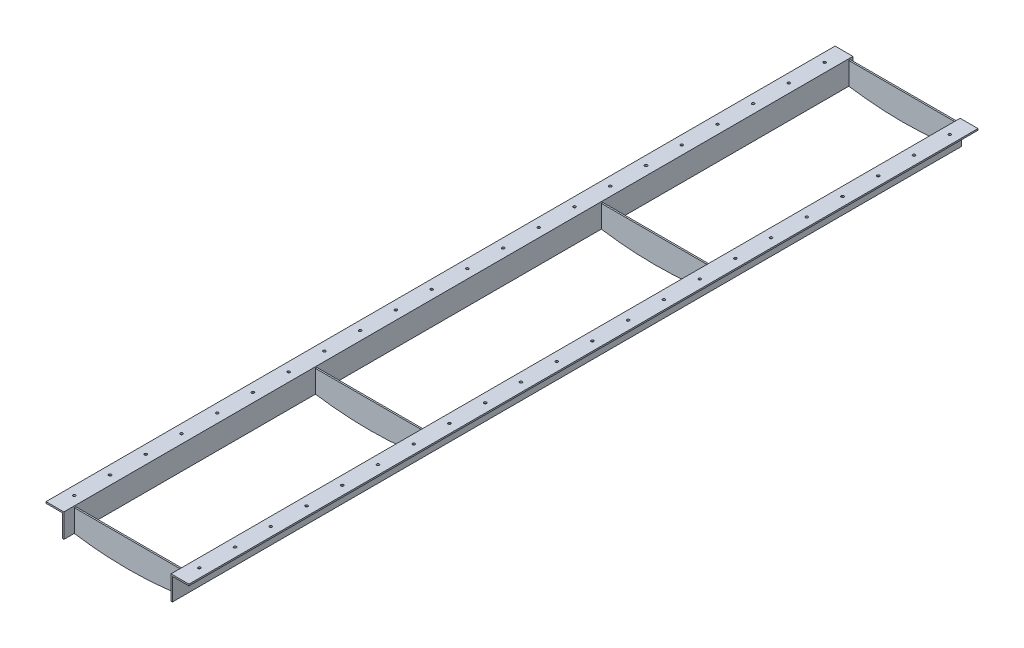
ISO-10303-21;
HEADER;
FILE_DESCRIPTION(('STEP AP214'),'2;1');
FILE_NAME('part.step','',(''),(''),'','','');
FILE_SCHEMA(('AUTOMOTIVE_DESIGN { 1 0 10303 214 1 1 1 1 }'));
ENDSEC;
DATA;
#1=APPLICATION_CONTEXT('core data for automotive mechanical design processes');
#2=APPLICATION_PROTOCOL_DEFINITION('international standard','automotive_design',2000,#1);
#3=PRODUCT_CONTEXT('',#1,'mechanical');
#4=PRODUCT('Part','Part','',(#3));
#5=PRODUCT_RELATED_PRODUCT_CATEGORY('part','',(#4));
#6=PRODUCT_DEFINITION_FORMATION('','',#4);
#7=PRODUCT_DEFINITION_CONTEXT('part definition',#1,'design');
#8=PRODUCT_DEFINITION('design','',#6,#7);
#9=PRODUCT_DEFINITION_SHAPE('','',#8);
#10=(LENGTH_UNIT() NAMED_UNIT(*) SI_UNIT(.MILLI.,.METRE.));
#11=(NAMED_UNIT(*) PLANE_ANGLE_UNIT() SI_UNIT($,.RADIAN.));
#12=(NAMED_UNIT(*) SI_UNIT($,.STERADIAN.) SOLID_ANGLE_UNIT());
#13=UNCERTAINTY_MEASURE_WITH_UNIT(LENGTH_MEASURE(1.E-05),#10,'distance_accuracy_value','');
#14=(GEOMETRIC_REPRESENTATION_CONTEXT(3) GLOBAL_UNCERTAINTY_ASSIGNED_CONTEXT((#13)) GLOBAL_UNIT_ASSIGNED_CONTEXT((#10,
#11,#12)) REPRESENTATION_CONTEXT('',''));
#15=CARTESIAN_POINT('',(0.,0.,0.));
#16=DIRECTION('',(0.,0.,1.));
#17=DIRECTION('',(1.,0.,0.));
#18=AXIS2_PLACEMENT_3D('',#15,#16,#17);
#19=CARTESIAN_POINT('',(0.,101.6,-3365.5));
#20=DIRECTION('',(-1.,0.,0.));
#21=DIRECTION('',(0.,-1.,0.));
#22=AXIS2_PLACEMENT_3D('',#19,#20,#21);
#23=PLANE('',#22);
#24=DIRECTION('',(0.,0.,1.));
#25=VECTOR('',#24,1.);
#26=CARTESIAN_POINT('',(0.,95.25,-3348.0375));
#27=LINE('',#26,#25);
#28=CARTESIAN_POINT('',(0.,95.25,-3354.3875));
#29=VERTEX_POINT('',#28);
#30=CARTESIAN_POINT('',(0.,95.25,-3348.0375));
#31=VERTEX_POINT('',#30);
#32=EDGE_CURVE('E709',#29,#31,#27,.T.);
#33=ORIENTED_EDGE('',*,*,#32,.T.);
#34=DIRECTION('',(0.,-1.,0.));
#35=VECTOR('',#34,1.);
#36=CARTESIAN_POINT('',(0.,95.25,-3348.0375));
#37=LINE('',#36,#35);
#38=CARTESIAN_POINT('',(0.,0.,-3348.0375));
#39=VERTEX_POINT('',#38);
#40=EDGE_CURVE('E723',#31,#39,#37,.T.);
#41=ORIENTED_EDGE('',*,*,#40,.T.);
#42=DIRECTION('',(0.,0.,1.));
#43=VECTOR('',#42,1.);
#44=CARTESIAN_POINT('',(0.,0.,-3365.5));
#45=LINE('',#44,#43);
#46=CARTESIAN_POINT('',(0.,0.,-2298.7));
#47=VERTEX_POINT('',#46);
#48=EDGE_CURVE('E327',#39,#47,#45,.T.);
#49=ORIENTED_EDGE('',*,*,#48,.T.);
#50=DIRECTION('',(0.,1.,0.));
#51=VECTOR('',#50,1.);
#52=CARTESIAN_POINT('',(0.,95.25,-2298.7));
#53=LINE('',#52,#51);
#54=CARTESIAN_POINT('',(0.,95.25,-2298.7));
#55=VERTEX_POINT('',#54);
#56=EDGE_CURVE('E699',#47,#55,#53,.T.);
#57=ORIENTED_EDGE('',*,*,#56,.T.);
#58=DIRECTION('',(0.,0.,1.));
#59=VECTOR('',#58,1.);
#60=CARTESIAN_POINT('',(0.,95.25,-2292.35));
#61=LINE('',#60,#59);
#62=CARTESIAN_POINT('',(0.,95.25,-2292.35));
#63=VERTEX_POINT('',#62);
#64=EDGE_CURVE('E686',#55,#63,#61,.T.);
#65=ORIENTED_EDGE('',*,*,#64,.T.);
#66=DIRECTION('',(0.,-1.,0.));
#67=VECTOR('',#66,1.);
#68=CARTESIAN_POINT('',(0.,95.25,-2292.35));
#69=LINE('',#68,#67);
#70=CARTESIAN_POINT('',(0.,0.,-2292.35));
#71=VERTEX_POINT('',#70);
#72=EDGE_CURVE('E700',#63,#71,#69,.T.);
#73=ORIENTED_EDGE('',*,*,#72,.T.);
#74=CARTESIAN_POINT('',(0.,0.,-1079.5));
#75=VERTEX_POINT('',#74);
#76=EDGE_CURVE('E889',#71,#75,#45,.T.);
#77=ORIENTED_EDGE('',*,*,#76,.T.);
#78=DIRECTION('',(0.,1.,0.));
#79=VECTOR('',#78,1.);
#80=CARTESIAN_POINT('',(0.,95.25,-1079.5));
#81=LINE('',#80,#79);
#82=CARTESIAN_POINT('',(0.,95.25,-1079.5));
#83=VERTEX_POINT('',#82);
#84=EDGE_CURVE('E676',#75,#83,#81,.T.);
#85=ORIENTED_EDGE('',*,*,#84,.T.);
#86=DIRECTION('',(0.,0.,1.));
#87=VECTOR('',#86,1.);
#88=CARTESIAN_POINT('',(0.,95.25,-1073.15));
#89=LINE('',#88,#87);
#90=CARTESIAN_POINT('',(0.,95.25,-1073.15));
#91=VERTEX_POINT('',#90);
#92=EDGE_CURVE('E663',#83,#91,#89,.T.);
#93=ORIENTED_EDGE('',*,*,#92,.T.);
#94=DIRECTION('',(0.,-1.,0.));
#95=VECTOR('',#94,1.);
#96=CARTESIAN_POINT('',(0.,95.25,-1073.15));
#97=LINE('',#96,#95);
#98=CARTESIAN_POINT('',(0.,0.,-1073.15));
#99=VERTEX_POINT('',#98);
#100=EDGE_CURVE('E677',#91,#99,#97,.T.);
#101=ORIENTED_EDGE('',*,*,#100,.T.);
#102=CARTESIAN_POINT('',(0.,0.,-50.8000000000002));
#103=VERTEX_POINT('',#102);
#104=EDGE_CURVE('E895',#99,#103,#45,.T.);
#105=ORIENTED_EDGE('',*,*,#104,.T.);
#106=DIRECTION('',(0.,1.,0.));
#107=VECTOR('',#106,1.);
#108=CARTESIAN_POINT('',(0.,95.25,-50.8000000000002));
#109=LINE('',#108,#107);
#110=CARTESIAN_POINT('',(0.,95.25,-50.8000000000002));
#111=VERTEX_POINT('',#110);
#112=EDGE_CURVE('E454',#103,#111,#109,.T.);
#113=ORIENTED_EDGE('',*,*,#112,.T.);
#114=DIRECTION('',(0.,0.,1.));
#115=VECTOR('',#114,1.);
#116=CARTESIAN_POINT('',(0.,95.25,-44.4500000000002));
#117=LINE('',#116,#115);
#118=CARTESIAN_POINT('',(0.,95.25,-44.4500000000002));
#119=VERTEX_POINT('',#118);
#120=EDGE_CURVE('E470',#111,#119,#117,.T.);
#121=ORIENTED_EDGE('',*,*,#120,.T.);
#122=DIRECTION('',(0.,-1.,0.));
#123=VECTOR('',#122,1.);
#124=CARTESIAN_POINT('',(0.,95.25,-44.4500000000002));
#125=LINE('',#124,#123);
#126=CARTESIAN_POINT('',(0.,0.,-44.4500000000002));
#127=VERTEX_POINT('',#126);
#128=EDGE_CURVE('E471',#119,#127,#125,.T.);
#129=ORIENTED_EDGE('',*,*,#128,.T.);
#130=CARTESIAN_POINT('',(0.,0.,0.));
#131=VERTEX_POINT('',#130);
#132=EDGE_CURVE('E331',#127,#131,#45,.T.);
#133=ORIENTED_EDGE('',*,*,#132,.T.);
#134=DIRECTION('',(0.,-1.,0.));
#135=VECTOR('',#134,1.);
#136=CARTESIAN_POINT('',(0.,101.6,0.));
#137=LINE('',#136,#135);
#138=CARTESIAN_POINT('',(0.,101.6,0.));
#139=VERTEX_POINT('',#138);
#140=EDGE_CURVE('E300',#139,#131,#137,.T.);
#141=ORIENTED_EDGE('',*,*,#140,.F.);
#142=DIRECTION('',(0.,0.,1.));
#143=VECTOR('',#142,1.);
#144=CARTESIAN_POINT('',(0.,101.6,-3365.5));
#145=LINE('',#144,#143);
#146=CARTESIAN_POINT('',(0.,101.6,-3365.5));
#147=VERTEX_POINT('',#146);
#148=EDGE_CURVE('E329',#147,#139,#145,.T.);
#149=ORIENTED_EDGE('',*,*,#148,.F.);
#150=DIRECTION('',(0.,-1.,0.));
#151=VECTOR('',#150,1.);
#152=CARTESIAN_POINT('',(0.,101.6,-3365.5));
#153=LINE('',#152,#151);
#154=CARTESIAN_POINT('',(0.,0.,-3365.5));
#155=VERTEX_POINT('',#154);
#156=EDGE_CURVE('E803',#147,#155,#153,.T.);
#157=ORIENTED_EDGE('',*,*,#156,.T.);
#158=CARTESIAN_POINT('',(0.,0.,-3354.3875));
#159=VERTEX_POINT('',#158);
#160=EDGE_CURVE('E323',#155,#159,#45,.T.);
#161=ORIENTED_EDGE('',*,*,#160,.T.);
#162=DIRECTION('',(0.,1.,0.));
#163=VECTOR('',#162,1.);
#164=CARTESIAN_POINT('',(0.,95.25,-3354.3875));
#165=LINE('',#164,#163);
#166=EDGE_CURVE('E722',#159,#29,#165,.T.);
#167=ORIENTED_EDGE('',*,*,#166,.T.);
#168=EDGE_LOOP('',(#33,#41,#49,#57,#65,#73,#77,#85,#93,#101,#105,#113,#121,#129,#133,#141,#149,
#157,#161,#167));
#169=FACE_BOUND('',#168,.T.);
#170=ADVANCED_FACE('F33',(#169),#23,.T.);
#171=CARTESIAN_POINT('',(-457.2,101.6,-3365.5));
#172=DIRECTION('',(1.,0.,0.));
#173=DIRECTION('',(0.,-1.,0.));
#174=AXIS2_PLACEMENT_3D('',#171,#172,#173);
#175=PLANE('',#174);
#176=DIRECTION('',(0.,0.,1.));
#177=VECTOR('',#176,1.);
#178=CARTESIAN_POINT('',(-457.2,0.,-3365.5));
#179=LINE('',#178,#177);
#180=CARTESIAN_POINT('',(-457.2,0.,-3348.0375));
#181=VERTEX_POINT('',#180);
#182=CARTESIAN_POINT('',(-457.2,0.,-2298.7));
#183=VERTEX_POINT('',#182);
#184=EDGE_CURVE('E614',#181,#183,#179,.T.);
#185=ORIENTED_EDGE('',*,*,#184,.F.);
#186=DIRECTION('',(0.,-1.,0.));
#187=VECTOR('',#186,1.);
#188=CARTESIAN_POINT('',(-457.2,95.25,-3348.0375));
#189=LINE('',#188,#187);
#190=CARTESIAN_POINT('',(-457.2,95.25,-3348.0375));
#191=VERTEX_POINT('',#190);
#192=EDGE_CURVE('E716',#191,#181,#189,.T.);
#193=ORIENTED_EDGE('',*,*,#192,.F.);
#194=DIRECTION('',(0.,0.,1.));
#195=VECTOR('',#194,1.);
#196=CARTESIAN_POINT('',(-457.2,95.25,-3348.0375));
#197=LINE('',#196,#195);
#198=CARTESIAN_POINT('',(-457.2,95.25,-3354.3875));
#199=VERTEX_POINT('',#198);
#200=EDGE_CURVE('E710',#199,#191,#197,.T.);
#201=ORIENTED_EDGE('',*,*,#200,.F.);
#202=DIRECTION('',(0.,1.,0.));
#203=VECTOR('',#202,1.);
#204=CARTESIAN_POINT('',(-457.2,95.25,-3354.3875));
#205=LINE('',#204,#203);
#206=CARTESIAN_POINT('',(-457.2,0.,-3354.3875));
#207=VERTEX_POINT('',#206);
#208=EDGE_CURVE('E715',#207,#199,#205,.T.);
#209=ORIENTED_EDGE('',*,*,#208,.F.);
#210=CARTESIAN_POINT('',(-457.2,0.,-3365.5));
#211=VERTEX_POINT('',#210);
#212=EDGE_CURVE('E466',#211,#207,#179,.T.);
#213=ORIENTED_EDGE('',*,*,#212,.F.);
#214=DIRECTION('',(0.,-1.,0.));
#215=VECTOR('',#214,1.);
#216=CARTESIAN_POINT('',(-457.2,101.6,-3365.5));
#217=LINE('',#216,#215);
#218=CARTESIAN_POINT('',(-457.2,101.6,-3365.5));
#219=VERTEX_POINT('',#218);
#220=EDGE_CURVE('E645',#219,#211,#217,.T.);
#221=ORIENTED_EDGE('',*,*,#220,.F.);
#222=DIRECTION('',(0.,0.,1.));
#223=VECTOR('',#222,1.);
#224=CARTESIAN_POINT('',(-457.2,101.6,-3365.5));
#225=LINE('',#224,#223);
#226=CARTESIAN_POINT('',(-457.2,101.6,0.));
#227=VERTEX_POINT('',#226);
#228=EDGE_CURVE('E607',#219,#227,#225,.T.);
#229=ORIENTED_EDGE('',*,*,#228,.T.);
#230=DIRECTION('',(0.,-1.,0.));
#231=VECTOR('',#230,1.);
#232=CARTESIAN_POINT('',(-457.2,101.6,0.));
#233=LINE('',#232,#231);
#234=CARTESIAN_POINT('',(-457.2,0.,0.));
#235=VERTEX_POINT('',#234);
#236=EDGE_CURVE('E632',#227,#235,#233,.T.);
#237=ORIENTED_EDGE('',*,*,#236,.T.);
#238=CARTESIAN_POINT('',(-457.2,0.,-44.4500000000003));
#239=VERTEX_POINT('',#238);
#240=EDGE_CURVE('E467',#239,#235,#179,.T.);
#241=ORIENTED_EDGE('',*,*,#240,.F.);
#242=DIRECTION('',(0.,-1.,0.));
#243=VECTOR('',#242,1.);
#244=CARTESIAN_POINT('',(-457.2,95.25,-44.4500000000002));
#245=LINE('',#244,#243);
#246=CARTESIAN_POINT('',(-457.2,95.25,-44.4500000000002));
#247=VERTEX_POINT('',#246);
#248=EDGE_CURVE('E823',#247,#239,#245,.T.);
#249=ORIENTED_EDGE('',*,*,#248,.F.);
#250=DIRECTION('',(0.,0.,1.));
#251=VECTOR('',#250,1.);
#252=CARTESIAN_POINT('',(-457.2,95.25,-44.4500000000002));
#253=LINE('',#252,#251);
#254=CARTESIAN_POINT('',(-457.2,95.25,-50.8000000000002));
#255=VERTEX_POINT('',#254);
#256=EDGE_CURVE('E478',#255,#247,#253,.T.);
#257=ORIENTED_EDGE('',*,*,#256,.F.);
#258=DIRECTION('',(0.,1.,0.));
#259=VECTOR('',#258,1.);
#260=CARTESIAN_POINT('',(-457.2,95.25,-50.8000000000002));
#261=LINE('',#260,#259);
#262=CARTESIAN_POINT('',(-457.2,0.,-50.8000000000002));
#263=VERTEX_POINT('',#262);
#264=EDGE_CURVE('E822',#263,#255,#261,.T.);
#265=ORIENTED_EDGE('',*,*,#264,.F.);
#266=CARTESIAN_POINT('',(-457.2,0.,-1073.15));
#267=VERTEX_POINT('',#266);
#268=EDGE_CURVE('E842',#267,#263,#179,.T.);
#269=ORIENTED_EDGE('',*,*,#268,.F.);
#270=DIRECTION('',(0.,-1.,0.));
#271=VECTOR('',#270,1.);
#272=CARTESIAN_POINT('',(-457.2,95.25,-1073.15));
#273=LINE('',#272,#271);
#274=CARTESIAN_POINT('',(-457.2,95.25,-1073.15));
#275=VERTEX_POINT('',#274);
#276=EDGE_CURVE('E670',#275,#267,#273,.T.);
#277=ORIENTED_EDGE('',*,*,#276,.F.);
#278=DIRECTION('',(0.,0.,1.));
#279=VECTOR('',#278,1.);
#280=CARTESIAN_POINT('',(-457.2,95.25,-1073.15));
#281=LINE('',#280,#279);
#282=CARTESIAN_POINT('',(-457.2,95.25,-1079.5));
#283=VERTEX_POINT('',#282);
#284=EDGE_CURVE('E664',#283,#275,#281,.T.);
#285=ORIENTED_EDGE('',*,*,#284,.F.);
#286=DIRECTION('',(0.,1.,0.));
#287=VECTOR('',#286,1.);
#288=CARTESIAN_POINT('',(-457.2,95.25,-1079.5));
#289=LINE('',#288,#287);
#290=CARTESIAN_POINT('',(-457.2,0.,-1079.5));
#291=VERTEX_POINT('',#290);
#292=EDGE_CURVE('E669',#291,#283,#289,.T.);
#293=ORIENTED_EDGE('',*,*,#292,.F.);
#294=CARTESIAN_POINT('',(-457.2,0.,-2292.35));
#295=VERTEX_POINT('',#294);
#296=EDGE_CURVE('E853',#295,#291,#179,.T.);
#297=ORIENTED_EDGE('',*,*,#296,.F.);
#298=DIRECTION('',(0.,-1.,0.));
#299=VECTOR('',#298,1.);
#300=CARTESIAN_POINT('',(-457.2,95.25,-2292.35));
#301=LINE('',#300,#299);
#302=CARTESIAN_POINT('',(-457.2,95.25,-2292.35));
#303=VERTEX_POINT('',#302);
#304=EDGE_CURVE('E693',#303,#295,#301,.T.);
#305=ORIENTED_EDGE('',*,*,#304,.F.);
#306=DIRECTION('',(0.,0.,1.));
#307=VECTOR('',#306,1.);
#308=CARTESIAN_POINT('',(-457.2,95.25,-2292.35));
#309=LINE('',#308,#307);
#310=CARTESIAN_POINT('',(-457.2,95.25,-2298.7));
#311=VERTEX_POINT('',#310);
#312=EDGE_CURVE('E687',#311,#303,#309,.T.);
#313=ORIENTED_EDGE('',*,*,#312,.F.);
#314=DIRECTION('',(0.,1.,0.));
#315=VECTOR('',#314,1.);
#316=CARTESIAN_POINT('',(-457.2,95.25,-2298.7));
#317=LINE('',#316,#315);
#318=EDGE_CURVE('E692',#183,#311,#317,.T.);
#319=ORIENTED_EDGE('',*,*,#318,.F.);
#320=EDGE_LOOP('',(#185,#193,#201,#209,#213,#221,#229,#237,#241,#249,#257,#265,#269,#277,#285,
#293,#297,#305,#313,#319));
#321=FACE_BOUND('',#320,.T.);
#322=ADVANCED_FACE('F838',(#321),#175,.T.);
#323=CARTESIAN_POINT('',(-457.2,0.,0.));
#324=DIRECTION('',(1.,0.,0.));
#325=DIRECTION('',(0.,0.,-1.));
#326=AXIS2_PLACEMENT_3D('',#323,#324,#325);
#327=PLANE('',#326);
#328=CARTESIAN_POINT('',(-457.2,-0.128642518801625,-50.8000000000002));
#329=VERTEX_POINT('',#328);
#330=EDGE_CURVE('E820',#329,#263,#261,.T.);
#331=ORIENTED_EDGE('',*,*,#330,.F.);
#332=DIRECTION('',(0.,0.,1.));
#333=VECTOR('',#332,1.);
#334=CARTESIAN_POINT('',(-457.2,-0.128642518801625,-3365.5));
#335=LINE('',#334,#333);
#336=CARTESIAN_POINT('',(-457.2,-0.128642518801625,-44.4500000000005));
#337=VERTEX_POINT('',#336);
#338=EDGE_CURVE('E295',#329,#337,#335,.T.);
#339=ORIENTED_EDGE('',*,*,#338,.T.);
#340=EDGE_CURVE('E483',#239,#337,#245,.T.);
#341=ORIENTED_EDGE('',*,*,#340,.F.);
#342=EDGE_CURVE('E41',#263,#239,#179,.T.);
#343=ORIENTED_EDGE('',*,*,#342,.F.);
#344=EDGE_LOOP('',(#331,#339,#341,#343));
#345=FACE_BOUND('',#344,.T.);
#346=ADVANCED_FACE('F834',(#345),#327,.F.);
#347=CARTESIAN_POINT('',(76.2,101.6,-3365.5));
#348=DIRECTION('',(0.,1.,0.));
#349=DIRECTION('',(-1.,0.,0.));
#350=AXIS2_PLACEMENT_3D('',#347,#348,#349);
#351=PLANE('',#350);
#352=CARTESIAN_POINT('',(38.1,101.6,-234.95));
#353=DIRECTION('',(0.,1.,0.));
#354=DIRECTION('',(0.,0.,1.));
#355=AXIS2_PLACEMENT_3D('',#352,#353,#354);
#356=CIRCLE('',#355,5.55624999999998);
#357=CARTESIAN_POINT('',(38.1,101.6,-229.39375));
#358=VERTEX_POINT('',#357);
#359=EDGE_CURVE('E808',#358,#358,#356,.T.);
#360=ORIENTED_EDGE('',*,*,#359,.F.);
#361=EDGE_LOOP('',(#360));
#362=FACE_BOUND('',#361,.T.);
#363=CARTESIAN_POINT('',(38.1,101.6,-82.55));
#364=DIRECTION('',(0.,1.,0.));
#365=DIRECTION('',(0.,0.,1.));
#366=AXIS2_PLACEMENT_3D('',#363,#364,#365);
#367=CIRCLE('',#366,5.55624999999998);
#368=CARTESIAN_POINT('',(38.1,101.6,-76.99375));
#369=VERTEX_POINT('',#368);
#370=EDGE_CURVE('E336',#369,#369,#367,.T.);
#371=ORIENTED_EDGE('',*,*,#370,.F.);
#372=EDGE_LOOP('',(#371));
#373=FACE_BOUND('',#372,.T.);
#374=DIRECTION('',(-1.,0.,0.));
#375=VECTOR('',#374,1.);
#376=CARTESIAN_POINT('',(76.2,101.6,0.));
#377=LINE('',#376,#375);
#378=CARTESIAN_POINT('',(76.2,101.6,0.));
#379=VERTEX_POINT('',#378);
#380=EDGE_CURVE('E305',#379,#139,#377,.T.);
#381=ORIENTED_EDGE('',*,*,#380,.F.);
#382=DIRECTION('',(0.,0.,1.));
#383=VECTOR('',#382,1.);
#384=CARTESIAN_POINT('',(76.2,101.6,-3365.5));
#385=LINE('',#384,#383);
#386=CARTESIAN_POINT('',(76.2,101.6,-3365.5));
#387=VERTEX_POINT('',#386);
#388=EDGE_CURVE('E315',#387,#379,#385,.T.);
#389=ORIENTED_EDGE('',*,*,#388,.F.);
#390=DIRECTION('',(-1.,0.,0.));
#391=VECTOR('',#390,1.);
#392=CARTESIAN_POINT('',(76.2,101.6,-3365.5));
#393=LINE('',#392,#391);
#394=EDGE_CURVE('E314',#387,#147,#393,.T.);
#395=ORIENTED_EDGE('',*,*,#394,.T.);
#396=ORIENTED_EDGE('',*,*,#148,.T.);
#397=EDGE_LOOP('',(#381,#389,#395,#396));
#398=FACE_BOUND('',#397,.T.);
#399=CARTESIAN_POINT('',(38.1,101.6,-387.35));
#400=DIRECTION('',(0.,1.,0.));
#401=DIRECTION('',(0.,0.,1.));
#402=AXIS2_PLACEMENT_3D('',#399,#400,#401);
#403=CIRCLE('',#402,5.55624999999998);
#404=CARTESIAN_POINT('',(38.1,101.6,-381.79375));
#405=VERTEX_POINT('',#404);
#406=EDGE_CURVE('E339',#405,#405,#403,.T.);
#407=ORIENTED_EDGE('',*,*,#406,.F.);
#408=EDGE_LOOP('',(#407));
#409=FACE_BOUND('',#408,.T.);
#410=CARTESIAN_POINT('',(38.1,101.6,-539.75));
#411=DIRECTION('',(0.,1.,0.));
#412=DIRECTION('',(0.,0.,1.));
#413=AXIS2_PLACEMENT_3D('',#410,#411,#412);
#414=CIRCLE('',#413,5.55624999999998);
#415=CARTESIAN_POINT('',(38.1,101.6,-534.19375));
#416=VERTEX_POINT('',#415);
#417=EDGE_CURVE('E345',#416,#416,#414,.T.);
#418=ORIENTED_EDGE('',*,*,#417,.F.);
#419=EDGE_LOOP('',(#418));
#420=FACE_BOUND('',#419,.T.);
#421=CARTESIAN_POINT('',(38.1,101.6,-692.15));
#422=DIRECTION('',(0.,1.,0.));
#423=DIRECTION('',(0.,0.,1.));
#424=AXIS2_PLACEMENT_3D('',#421,#422,#423);
#425=CIRCLE('',#424,5.55624999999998);
#426=CARTESIAN_POINT('',(38.1,101.6,-686.59375));
#427=VERTEX_POINT('',#426);
#428=EDGE_CURVE('E351',#427,#427,#425,.T.);
#429=ORIENTED_EDGE('',*,*,#428,.F.);
#430=EDGE_LOOP('',(#429));
#431=FACE_BOUND('',#430,.T.);
#432=CARTESIAN_POINT('',(38.1,101.6,-844.55));
#433=DIRECTION('',(0.,1.,0.));
#434=DIRECTION('',(0.,0.,1.));
#435=AXIS2_PLACEMENT_3D('',#432,#433,#434);
#436=CIRCLE('',#435,5.55624999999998);
#437=CARTESIAN_POINT('',(38.1,101.6,-838.99375));
#438=VERTEX_POINT('',#437);
#439=EDGE_CURVE('E357',#438,#438,#436,.T.);
#440=ORIENTED_EDGE('',*,*,#439,.F.);
#441=EDGE_LOOP('',(#440));
#442=FACE_BOUND('',#441,.T.);
#443=CARTESIAN_POINT('',(38.1,101.6,-996.95));
#444=DIRECTION('',(0.,1.,0.));
#445=DIRECTION('',(0.,0.,1.));
#446=AXIS2_PLACEMENT_3D('',#443,#444,#445);
#447=CIRCLE('',#446,5.55624999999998);
#448=CARTESIAN_POINT('',(38.1,101.6,-991.39375));
#449=VERTEX_POINT('',#448);
#450=EDGE_CURVE('E363',#449,#449,#447,.T.);
#451=ORIENTED_EDGE('',*,*,#450,.F.);
#452=EDGE_LOOP('',(#451));
#453=FACE_BOUND('',#452,.T.);
#454=CARTESIAN_POINT('',(38.1,101.6,-1149.35));
#455=DIRECTION('',(0.,1.,0.));
#456=DIRECTION('',(0.,0.,1.));
#457=AXIS2_PLACEMENT_3D('',#454,#455,#456);
#458=CIRCLE('',#457,5.55624999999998);
#459=CARTESIAN_POINT('',(38.1,101.6,-1143.79375));
#460=VERTEX_POINT('',#459);
#461=EDGE_CURVE('E369',#460,#460,#458,.T.);
#462=ORIENTED_EDGE('',*,*,#461,.F.);
#463=EDGE_LOOP('',(#462));
#464=FACE_BOUND('',#463,.T.);
#465=CARTESIAN_POINT('',(38.1,101.6,-1301.75));
#466=DIRECTION('',(0.,1.,0.));
#467=DIRECTION('',(0.,0.,1.));
#468=AXIS2_PLACEMENT_3D('',#465,#466,#467);
#469=CIRCLE('',#468,5.55624999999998);
#470=CARTESIAN_POINT('',(38.1,101.6,-1296.19375));
#471=VERTEX_POINT('',#470);
#472=EDGE_CURVE('E375',#471,#471,#469,.T.);
#473=ORIENTED_EDGE('',*,*,#472,.F.);
#474=EDGE_LOOP('',(#473));
#475=FACE_BOUND('',#474,.T.);
#476=CARTESIAN_POINT('',(38.1,101.6,-1454.15));
#477=DIRECTION('',(0.,1.,0.));
#478=DIRECTION('',(0.,0.,1.));
#479=AXIS2_PLACEMENT_3D('',#476,#477,#478);
#480=CIRCLE('',#479,5.55624999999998);
#481=CARTESIAN_POINT('',(38.1,101.6,-1448.59375));
#482=VERTEX_POINT('',#481);
#483=EDGE_CURVE('E381',#482,#482,#480,.T.);
#484=ORIENTED_EDGE('',*,*,#483,.F.);
#485=EDGE_LOOP('',(#484));
#486=FACE_BOUND('',#485,.T.);
#487=CARTESIAN_POINT('',(38.1,101.6,-1606.55));
#488=DIRECTION('',(0.,1.,0.));
#489=DIRECTION('',(0.,0.,1.));
#490=AXIS2_PLACEMENT_3D('',#487,#488,#489);
#491=CIRCLE('',#490,5.55624999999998);
#492=CARTESIAN_POINT('',(38.1,101.6,-1600.99375));
#493=VERTEX_POINT('',#492);
#494=EDGE_CURVE('E387',#493,#493,#491,.T.);
#495=ORIENTED_EDGE('',*,*,#494,.F.);
#496=EDGE_LOOP('',(#495));
#497=FACE_BOUND('',#496,.T.);
#498=CARTESIAN_POINT('',(38.1,101.6,-1758.95));
#499=DIRECTION('',(0.,1.,0.));
#500=DIRECTION('',(0.,0.,1.));
#501=AXIS2_PLACEMENT_3D('',#498,#499,#500);
#502=CIRCLE('',#501,5.55624999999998);
#503=CARTESIAN_POINT('',(38.1,101.6,-1753.39375));
#504=VERTEX_POINT('',#503);
#505=EDGE_CURVE('E393',#504,#504,#502,.T.);
#506=ORIENTED_EDGE('',*,*,#505,.F.);
#507=EDGE_LOOP('',(#506));
#508=FACE_BOUND('',#507,.T.);
#509=CARTESIAN_POINT('',(38.1,101.6,-1911.35));
#510=DIRECTION('',(0.,1.,0.));
#511=DIRECTION('',(0.,0.,1.));
#512=AXIS2_PLACEMENT_3D('',#509,#510,#511);
#513=CIRCLE('',#512,5.55624999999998);
#514=CARTESIAN_POINT('',(38.1,101.6,-1905.79375));
#515=VERTEX_POINT('',#514);
#516=EDGE_CURVE('E399',#515,#515,#513,.T.);
#517=ORIENTED_EDGE('',*,*,#516,.F.);
#518=EDGE_LOOP('',(#517));
#519=FACE_BOUND('',#518,.T.);
#520=CARTESIAN_POINT('',(38.1,101.6,-2063.75));
#521=DIRECTION('',(0.,1.,0.));
#522=DIRECTION('',(0.,0.,1.));
#523=AXIS2_PLACEMENT_3D('',#520,#521,#522);
#524=CIRCLE('',#523,5.55624999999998);
#525=CARTESIAN_POINT('',(38.1,101.6,-2058.19375));
#526=VERTEX_POINT('',#525);
#527=EDGE_CURVE('E405',#526,#526,#524,.T.);
#528=ORIENTED_EDGE('',*,*,#527,.F.);
#529=EDGE_LOOP('',(#528));
#530=FACE_BOUND('',#529,.T.);
#531=CARTESIAN_POINT('',(38.1,101.6,-2216.15));
#532=DIRECTION('',(0.,1.,0.));
#533=DIRECTION('',(0.,0.,1.));
#534=AXIS2_PLACEMENT_3D('',#531,#532,#533);
#535=CIRCLE('',#534,5.55624999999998);
#536=CARTESIAN_POINT('',(38.1,101.6,-2210.59375));
#537=VERTEX_POINT('',#536);
#538=EDGE_CURVE('E411',#537,#537,#535,.T.);
#539=ORIENTED_EDGE('',*,*,#538,.F.);
#540=EDGE_LOOP('',(#539));
#541=FACE_BOUND('',#540,.T.);
#542=CARTESIAN_POINT('',(38.1,101.6,-2368.55));
#543=DIRECTION('',(0.,1.,0.));
#544=DIRECTION('',(0.,0.,1.));
#545=AXIS2_PLACEMENT_3D('',#542,#543,#544);
#546=CIRCLE('',#545,5.55624999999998);
#547=CARTESIAN_POINT('',(38.1,101.6,-2362.99375));
#548=VERTEX_POINT('',#547);
#549=EDGE_CURVE('E417',#548,#548,#546,.T.);
#550=ORIENTED_EDGE('',*,*,#549,.F.);
#551=EDGE_LOOP('',(#550));
#552=FACE_BOUND('',#551,.T.);
#553=CARTESIAN_POINT('',(38.1,101.6,-2520.95));
#554=DIRECTION('',(0.,1.,0.));
#555=DIRECTION('',(0.,0.,1.));
#556=AXIS2_PLACEMENT_3D('',#553,#554,#555);
#557=CIRCLE('',#556,5.55624999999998);
#558=CARTESIAN_POINT('',(38.1,101.6,-2515.39375));
#559=VERTEX_POINT('',#558);
#560=EDGE_CURVE('E423',#559,#559,#557,.T.);
#561=ORIENTED_EDGE('',*,*,#560,.F.);
#562=EDGE_LOOP('',(#561));
#563=FACE_BOUND('',#562,.T.);
#564=CARTESIAN_POINT('',(38.1,101.6,-2673.35));
#565=DIRECTION('',(0.,1.,0.));
#566=DIRECTION('',(0.,0.,1.));
#567=AXIS2_PLACEMENT_3D('',#564,#565,#566);
#568=CIRCLE('',#567,5.55624999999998);
#569=CARTESIAN_POINT('',(38.1,101.6,-2667.79375));
#570=VERTEX_POINT('',#569);
#571=EDGE_CURVE('E429',#570,#570,#568,.T.);
#572=ORIENTED_EDGE('',*,*,#571,.F.);
#573=EDGE_LOOP('',(#572));
#574=FACE_BOUND('',#573,.T.);
#575=CARTESIAN_POINT('',(38.1,101.6,-2825.75));
#576=DIRECTION('',(0.,1.,0.));
#577=DIRECTION('',(0.,0.,1.));
#578=AXIS2_PLACEMENT_3D('',#575,#576,#577);
#579=CIRCLE('',#578,5.55624999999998);
#580=CARTESIAN_POINT('',(38.1,101.6,-2820.19375));
#581=VERTEX_POINT('',#580);
#582=EDGE_CURVE('E435',#581,#581,#579,.T.);
#583=ORIENTED_EDGE('',*,*,#582,.F.);
#584=EDGE_LOOP('',(#583));
#585=FACE_BOUND('',#584,.T.);
#586=CARTESIAN_POINT('',(38.1,101.6,-2978.15));
#587=DIRECTION('',(0.,1.,0.));
#588=DIRECTION('',(0.,0.,1.));
#589=AXIS2_PLACEMENT_3D('',#586,#587,#588);
#590=CIRCLE('',#589,5.55624999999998);
#591=CARTESIAN_POINT('',(38.1,101.6,-2972.59375));
#592=VERTEX_POINT('',#591);
#593=EDGE_CURVE('E441',#592,#592,#590,.T.);
#594=ORIENTED_EDGE('',*,*,#593,.F.);
#595=EDGE_LOOP('',(#594));
#596=FACE_BOUND('',#595,.T.);
#597=CARTESIAN_POINT('',(38.1,101.6,-3130.55));
#598=DIRECTION('',(0.,1.,0.));
#599=DIRECTION('',(0.,0.,1.));
#600=AXIS2_PLACEMENT_3D('',#597,#598,#599);
#601=CIRCLE('',#600,5.55624999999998);
#602=CARTESIAN_POINT('',(38.1,101.6,-3124.99375));
#603=VERTEX_POINT('',#602);
#604=EDGE_CURVE('E447',#603,#603,#601,.T.);
#605=ORIENTED_EDGE('',*,*,#604,.F.);
#606=EDGE_LOOP('',(#605));
#607=FACE_BOUND('',#606,.T.);
#608=CARTESIAN_POINT('',(38.1,101.6,-3282.95));
#609=DIRECTION('',(0.,1.,0.));
#610=DIRECTION('',(0.,0.,1.));
#611=AXIS2_PLACEMENT_3D('',#608,#609,#610);
#612=CIRCLE('',#611,5.55624999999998);
#613=CARTESIAN_POINT('',(38.1,101.6,-3277.39375));
#614=VERTEX_POINT('',#613);
#615=EDGE_CURVE('E452',#614,#614,#612,.T.);
#616=ORIENTED_EDGE('',*,*,#615,.F.);
#617=EDGE_LOOP('',(#616));
#618=FACE_BOUND('',#617,.T.);
#619=ADVANCED_FACE('F795',(#362,#373,#398,#409,#420,#431,#442,#453,#464,#475,#486,#497,#508,
#519,#530,#541,#552,#563,#574,#585,#596,#607,#618),#351,.T.);
#620=CARTESIAN_POINT('',(76.2,95.25,-3365.5));
#621=DIRECTION('',(1.,0.,0.));
#622=DIRECTION('',(0.,0.,-1.));
#623=AXIS2_PLACEMENT_3D('',#620,#621,#622);
#624=PLANE('',#623);
#625=DIRECTION('',(0.,1.,0.));
#626=VECTOR('',#625,1.);
#627=CARTESIAN_POINT('',(76.2,95.25,0.));
#628=LINE('',#627,#626);
#629=CARTESIAN_POINT('',(76.2,95.25,0.));
#630=VERTEX_POINT('',#629);
#631=EDGE_CURVE('E311',#630,#379,#628,.T.);
#632=ORIENTED_EDGE('',*,*,#631,.F.);
#633=DIRECTION('',(0.,0.,1.));
#634=VECTOR('',#633,1.);
#635=CARTESIAN_POINT('',(76.2,95.25,-3365.5));
#636=LINE('',#635,#634);
#637=CARTESIAN_POINT('',(76.2,95.25,-3365.5));
#638=VERTEX_POINT('',#637);
#639=EDGE_CURVE('E318',#638,#630,#636,.T.);
#640=ORIENTED_EDGE('',*,*,#639,.F.);
#641=DIRECTION('',(0.,1.,0.));
#642=VECTOR('',#641,1.);
#643=CARTESIAN_POINT('',(76.2,95.25,-3365.5));
#644=LINE('',#643,#642);
#645=EDGE_CURVE('E332',#638,#387,#644,.T.);
#646=ORIENTED_EDGE('',*,*,#645,.T.);
#647=ORIENTED_EDGE('',*,*,#388,.T.);
#648=EDGE_LOOP('',(#632,#640,#646,#647));
#649=FACE_BOUND('',#648,.T.);
#650=ADVANCED_FACE('F787',(#649),#624,.T.);
#651=CARTESIAN_POINT('',(6.34999999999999,95.25,-3365.5));
#652=DIRECTION('',(0.,-1.,0.));
#653=DIRECTION('',(1.,0.,0.));
#654=AXIS2_PLACEMENT_3D('',#651,#652,#653);
#655=PLANE('',#654);
#656=CARTESIAN_POINT('',(38.1,95.25,-234.95));
#657=DIRECTION('',(0.,-1.,0.));
#658=DIRECTION('',(1.,0.,0.));
#659=AXIS2_PLACEMENT_3D('',#656,#657,#658);
#660=CIRCLE('',#659,5.55624999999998);
#661=CARTESIAN_POINT('',(43.6562499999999,95.25,-234.95));
#662=VERTEX_POINT('',#661);
#663=EDGE_CURVE('E811',#662,#662,#660,.T.);
#664=ORIENTED_EDGE('',*,*,#663,.F.);
#665=EDGE_LOOP('',(#664));
#666=FACE_BOUND('',#665,.T.);
#667=CARTESIAN_POINT('',(38.1,95.25,-82.55));
#668=DIRECTION('',(0.,-1.,0.));
#669=DIRECTION('',(1.,0.,0.));
#670=AXIS2_PLACEMENT_3D('',#667,#668,#669);
#671=CIRCLE('',#670,5.55624999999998);
#672=CARTESIAN_POINT('',(43.6562499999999,95.25,-82.55));
#673=VERTEX_POINT('',#672);
#674=EDGE_CURVE('E333',#673,#673,#671,.T.);
#675=ORIENTED_EDGE('',*,*,#674,.F.);
#676=EDGE_LOOP('',(#675));
#677=FACE_BOUND('',#676,.T.);
#678=DIRECTION('',(1.,0.,0.));
#679=VECTOR('',#678,1.);
#680=CARTESIAN_POINT('',(6.34999999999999,95.25,0.));
#681=LINE('',#680,#679);
#682=CARTESIAN_POINT('',(6.34999999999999,95.25,0.));
#683=VERTEX_POINT('',#682);
#684=EDGE_CURVE('E303',#683,#630,#681,.T.);
#685=ORIENTED_EDGE('',*,*,#684,.F.);
#686=DIRECTION('',(0.,0.,1.));
#687=VECTOR('',#686,1.);
#688=CARTESIAN_POINT('',(6.34999999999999,95.25,-3365.5));
#689=LINE('',#688,#687);
#690=CARTESIAN_POINT('',(6.34999999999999,95.25,-3365.5));
#691=VERTEX_POINT('',#690);
#692=EDGE_CURVE('E320',#691,#683,#689,.T.);
#693=ORIENTED_EDGE('',*,*,#692,.F.);
#694=DIRECTION('',(1.,0.,0.));
#695=VECTOR('',#694,1.);
#696=CARTESIAN_POINT('',(6.34999999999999,95.25,-3365.5));
#697=LINE('',#696,#695);
#698=EDGE_CURVE('E799',#691,#638,#697,.T.);
#699=ORIENTED_EDGE('',*,*,#698,.T.);
#700=ORIENTED_EDGE('',*,*,#639,.T.);
#701=EDGE_LOOP('',(#685,#693,#699,#700));
#702=FACE_BOUND('',#701,.T.);
#703=CARTESIAN_POINT('',(38.1,95.25,-387.35));
#704=DIRECTION('',(0.,-1.,0.));
#705=DIRECTION('',(1.,0.,0.));
#706=AXIS2_PLACEMENT_3D('',#703,#704,#705);
#707=CIRCLE('',#706,5.55624999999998);
#708=CARTESIAN_POINT('',(43.6562499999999,95.25,-387.35));
#709=VERTEX_POINT('',#708);
#710=EDGE_CURVE('E317',#709,#709,#707,.T.);
#711=ORIENTED_EDGE('',*,*,#710,.F.);
#712=EDGE_LOOP('',(#711));
#713=FACE_BOUND('',#712,.T.);
#714=CARTESIAN_POINT('',(38.1,95.25,-539.75));
#715=DIRECTION('',(0.,-1.,0.));
#716=DIRECTION('',(1.,0.,0.));
#717=AXIS2_PLACEMENT_3D('',#714,#715,#716);
#718=CIRCLE('',#717,5.55624999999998);
#719=CARTESIAN_POINT('',(43.6562499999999,95.25,-539.75));
#720=VERTEX_POINT('',#719);
#721=EDGE_CURVE('E342',#720,#720,#718,.T.);
#722=ORIENTED_EDGE('',*,*,#721,.F.);
#723=EDGE_LOOP('',(#722));
#724=FACE_BOUND('',#723,.T.);
#725=CARTESIAN_POINT('',(38.1,95.25,-692.15));
#726=DIRECTION('',(0.,-1.,0.));
#727=DIRECTION('',(1.,0.,0.));
#728=AXIS2_PLACEMENT_3D('',#725,#726,#727);
#729=CIRCLE('',#728,5.55624999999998);
#730=CARTESIAN_POINT('',(43.6562499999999,95.25,-692.15));
#731=VERTEX_POINT('',#730);
#732=EDGE_CURVE('E348',#731,#731,#729,.T.);
#733=ORIENTED_EDGE('',*,*,#732,.F.);
#734=EDGE_LOOP('',(#733));
#735=FACE_BOUND('',#734,.T.);
#736=CARTESIAN_POINT('',(38.1,95.25,-844.55));
#737=DIRECTION('',(0.,-1.,0.));
#738=DIRECTION('',(1.,0.,0.));
#739=AXIS2_PLACEMENT_3D('',#736,#737,#738);
#740=CIRCLE('',#739,5.55624999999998);
#741=CARTESIAN_POINT('',(43.6562499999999,95.25,-844.55));
#742=VERTEX_POINT('',#741);
#743=EDGE_CURVE('E354',#742,#742,#740,.T.);
#744=ORIENTED_EDGE('',*,*,#743,.F.);
#745=EDGE_LOOP('',(#744));
#746=FACE_BOUND('',#745,.T.);
#747=CARTESIAN_POINT('',(38.1,95.25,-996.95));
#748=DIRECTION('',(0.,-1.,0.));
#749=DIRECTION('',(1.,0.,0.));
#750=AXIS2_PLACEMENT_3D('',#747,#748,#749);
#751=CIRCLE('',#750,5.55624999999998);
#752=CARTESIAN_POINT('',(43.6562499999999,95.25,-996.95));
#753=VERTEX_POINT('',#752);
#754=EDGE_CURVE('E360',#753,#753,#751,.T.);
#755=ORIENTED_EDGE('',*,*,#754,.F.);
#756=EDGE_LOOP('',(#755));
#757=FACE_BOUND('',#756,.T.);
#758=CARTESIAN_POINT('',(38.1,95.25,-1149.35));
#759=DIRECTION('',(0.,-1.,0.));
#760=DIRECTION('',(1.,0.,0.));
#761=AXIS2_PLACEMENT_3D('',#758,#759,#760);
#762=CIRCLE('',#761,5.55624999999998);
#763=CARTESIAN_POINT('',(43.6562499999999,95.25,-1149.35));
#764=VERTEX_POINT('',#763);
#765=EDGE_CURVE('E366',#764,#764,#762,.T.);
#766=ORIENTED_EDGE('',*,*,#765,.F.);
#767=EDGE_LOOP('',(#766));
#768=FACE_BOUND('',#767,.T.);
#769=CARTESIAN_POINT('',(38.1,95.25,-1301.75));
#770=DIRECTION('',(0.,-1.,0.));
#771=DIRECTION('',(1.,0.,0.));
#772=AXIS2_PLACEMENT_3D('',#769,#770,#771);
#773=CIRCLE('',#772,5.55624999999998);
#774=CARTESIAN_POINT('',(43.6562499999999,95.25,-1301.75));
#775=VERTEX_POINT('',#774);
#776=EDGE_CURVE('E372',#775,#775,#773,.T.);
#777=ORIENTED_EDGE('',*,*,#776,.F.);
#778=EDGE_LOOP('',(#777));
#779=FACE_BOUND('',#778,.T.);
#780=CARTESIAN_POINT('',(38.1,95.25,-1454.15));
#781=DIRECTION('',(0.,-1.,0.));
#782=DIRECTION('',(1.,0.,0.));
#783=AXIS2_PLACEMENT_3D('',#780,#781,#782);
#784=CIRCLE('',#783,5.55624999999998);
#785=CARTESIAN_POINT('',(43.6562499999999,95.25,-1454.15));
#786=VERTEX_POINT('',#785);
#787=EDGE_CURVE('E378',#786,#786,#784,.T.);
#788=ORIENTED_EDGE('',*,*,#787,.F.);
#789=EDGE_LOOP('',(#788));
#790=FACE_BOUND('',#789,.T.);
#791=CARTESIAN_POINT('',(38.1,95.25,-1606.55));
#792=DIRECTION('',(0.,-1.,0.));
#793=DIRECTION('',(1.,0.,0.));
#794=AXIS2_PLACEMENT_3D('',#791,#792,#793);
#795=CIRCLE('',#794,5.55624999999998);
#796=CARTESIAN_POINT('',(43.6562499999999,95.25,-1606.55));
#797=VERTEX_POINT('',#796);
#798=EDGE_CURVE('E384',#797,#797,#795,.T.);
#799=ORIENTED_EDGE('',*,*,#798,.F.);
#800=EDGE_LOOP('',(#799));
#801=FACE_BOUND('',#800,.T.);
#802=CARTESIAN_POINT('',(38.1,95.25,-1758.95));
#803=DIRECTION('',(0.,-1.,0.));
#804=DIRECTION('',(1.,0.,0.));
#805=AXIS2_PLACEMENT_3D('',#802,#803,#804);
#806=CIRCLE('',#805,5.55624999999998);
#807=CARTESIAN_POINT('',(43.6562499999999,95.25,-1758.95));
#808=VERTEX_POINT('',#807);
#809=EDGE_CURVE('E390',#808,#808,#806,.T.);
#810=ORIENTED_EDGE('',*,*,#809,.F.);
#811=EDGE_LOOP('',(#810));
#812=FACE_BOUND('',#811,.T.);
#813=CARTESIAN_POINT('',(38.1,95.25,-1911.35));
#814=DIRECTION('',(0.,-1.,0.));
#815=DIRECTION('',(1.,0.,0.));
#816=AXIS2_PLACEMENT_3D('',#813,#814,#815);
#817=CIRCLE('',#816,5.55624999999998);
#818=CARTESIAN_POINT('',(43.6562499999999,95.25,-1911.35));
#819=VERTEX_POINT('',#818);
#820=EDGE_CURVE('E396',#819,#819,#817,.T.);
#821=ORIENTED_EDGE('',*,*,#820,.F.);
#822=EDGE_LOOP('',(#821));
#823=FACE_BOUND('',#822,.T.);
#824=CARTESIAN_POINT('',(38.1,95.25,-2063.75));
#825=DIRECTION('',(0.,-1.,0.));
#826=DIRECTION('',(1.,0.,0.));
#827=AXIS2_PLACEMENT_3D('',#824,#825,#826);
#828=CIRCLE('',#827,5.55624999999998);
#829=CARTESIAN_POINT('',(43.6562499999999,95.25,-2063.75));
#830=VERTEX_POINT('',#829);
#831=EDGE_CURVE('E402',#830,#830,#828,.T.);
#832=ORIENTED_EDGE('',*,*,#831,.F.);
#833=EDGE_LOOP('',(#832));
#834=FACE_BOUND('',#833,.T.);
#835=CARTESIAN_POINT('',(38.1,95.25,-2216.15));
#836=DIRECTION('',(0.,-1.,0.));
#837=DIRECTION('',(1.,0.,0.));
#838=AXIS2_PLACEMENT_3D('',#835,#836,#837);
#839=CIRCLE('',#838,5.55624999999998);
#840=CARTESIAN_POINT('',(43.6562499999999,95.25,-2216.15));
#841=VERTEX_POINT('',#840);
#842=EDGE_CURVE('E408',#841,#841,#839,.T.);
#843=ORIENTED_EDGE('',*,*,#842,.F.);
#844=EDGE_LOOP('',(#843));
#845=FACE_BOUND('',#844,.T.);
#846=CARTESIAN_POINT('',(38.1,95.25,-2368.55));
#847=DIRECTION('',(0.,-1.,0.));
#848=DIRECTION('',(1.,0.,0.));
#849=AXIS2_PLACEMENT_3D('',#846,#847,#848);
#850=CIRCLE('',#849,5.55624999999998);
#851=CARTESIAN_POINT('',(43.6562499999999,95.25,-2368.55));
#852=VERTEX_POINT('',#851);
#853=EDGE_CURVE('E414',#852,#852,#850,.T.);
#854=ORIENTED_EDGE('',*,*,#853,.F.);
#855=EDGE_LOOP('',(#854));
#856=FACE_BOUND('',#855,.T.);
#857=CARTESIAN_POINT('',(38.1,95.25,-2520.95));
#858=DIRECTION('',(0.,-1.,0.));
#859=DIRECTION('',(1.,0.,0.));
#860=AXIS2_PLACEMENT_3D('',#857,#858,#859);
#861=CIRCLE('',#860,5.55624999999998);
#862=CARTESIAN_POINT('',(43.6562499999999,95.25,-2520.95));
#863=VERTEX_POINT('',#862);
#864=EDGE_CURVE('E420',#863,#863,#861,.T.);
#865=ORIENTED_EDGE('',*,*,#864,.F.);
#866=EDGE_LOOP('',(#865));
#867=FACE_BOUND('',#866,.T.);
#868=CARTESIAN_POINT('',(38.1,95.25,-2673.35));
#869=DIRECTION('',(0.,-1.,0.));
#870=DIRECTION('',(1.,0.,0.));
#871=AXIS2_PLACEMENT_3D('',#868,#869,#870);
#872=CIRCLE('',#871,5.55624999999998);
#873=CARTESIAN_POINT('',(43.6562499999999,95.25,-2673.35));
#874=VERTEX_POINT('',#873);
#875=EDGE_CURVE('E426',#874,#874,#872,.T.);
#876=ORIENTED_EDGE('',*,*,#875,.F.);
#877=EDGE_LOOP('',(#876));
#878=FACE_BOUND('',#877,.T.);
#879=CARTESIAN_POINT('',(38.1,95.25,-2825.75));
#880=DIRECTION('',(0.,-1.,0.));
#881=DIRECTION('',(1.,0.,0.));
#882=AXIS2_PLACEMENT_3D('',#879,#880,#881);
#883=CIRCLE('',#882,5.55624999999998);
#884=CARTESIAN_POINT('',(43.6562499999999,95.25,-2825.75));
#885=VERTEX_POINT('',#884);
#886=EDGE_CURVE('E432',#885,#885,#883,.T.);
#887=ORIENTED_EDGE('',*,*,#886,.F.);
#888=EDGE_LOOP('',(#887));
#889=FACE_BOUND('',#888,.T.);
#890=CARTESIAN_POINT('',(38.1,95.25,-2978.15));
#891=DIRECTION('',(0.,-1.,0.));
#892=DIRECTION('',(1.,0.,0.));
#893=AXIS2_PLACEMENT_3D('',#890,#891,#892);
#894=CIRCLE('',#893,5.55624999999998);
#895=CARTESIAN_POINT('',(43.6562499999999,95.25,-2978.15));
#896=VERTEX_POINT('',#895);
#897=EDGE_CURVE('E438',#896,#896,#894,.T.);
#898=ORIENTED_EDGE('',*,*,#897,.F.);
#899=EDGE_LOOP('',(#898));
#900=FACE_BOUND('',#899,.T.);
#901=CARTESIAN_POINT('',(38.1,95.25,-3130.55));
#902=DIRECTION('',(0.,-1.,0.));
#903=DIRECTION('',(1.,0.,0.));
#904=AXIS2_PLACEMENT_3D('',#901,#902,#903);
#905=CIRCLE('',#904,5.55624999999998);
#906=CARTESIAN_POINT('',(43.6562499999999,95.25,-3130.55));
#907=VERTEX_POINT('',#906);
#908=EDGE_CURVE('E444',#907,#907,#905,.T.);
#909=ORIENTED_EDGE('',*,*,#908,.F.);
#910=EDGE_LOOP('',(#909));
#911=FACE_BOUND('',#910,.T.);
#912=CARTESIAN_POINT('',(38.1,95.25,-3282.95));
#913=DIRECTION('',(0.,-1.,0.));
#914=DIRECTION('',(1.,0.,0.));
#915=AXIS2_PLACEMENT_3D('',#912,#913,#914);
#916=CIRCLE('',#915,5.55624999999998);
#917=CARTESIAN_POINT('',(43.6562499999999,95.25,-3282.95));
#918=VERTEX_POINT('',#917);
#919=EDGE_CURVE('E450',#918,#918,#916,.T.);
#920=ORIENTED_EDGE('',*,*,#919,.F.);
#921=EDGE_LOOP('',(#920));
#922=FACE_BOUND('',#921,.T.);
#923=ADVANCED_FACE('F1013',(#666,#677,#702,#713,#724,#735,#746,#757,#768,#779,#790,#801,#812,
#823,#834,#845,#856,#867,#878,#889,#900,#911,#922),#655,.T.);
#924=CARTESIAN_POINT('',(6.35,0.,-3365.5));
#925=DIRECTION('',(1.,0.,0.));
#926=DIRECTION('',(0.,1.,0.));
#927=AXIS2_PLACEMENT_3D('',#924,#925,#926);
#928=PLANE('',#927);
#929=DIRECTION('',(0.,0.,1.));
#930=VECTOR('',#929,1.);
#931=CARTESIAN_POINT('',(6.34999999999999,0.853692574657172,-3365.5));
#932=LINE('',#931,#930);
#933=CARTESIAN_POINT('',(6.35000000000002,0.853692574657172,-3365.5));
#934=VERTEX_POINT('',#933);
#935=CARTESIAN_POINT('',(6.34999999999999,0.853692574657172,0.));
#936=VERTEX_POINT('',#935);
#937=EDGE_CURVE('E48',#934,#936,#932,.T.);
#938=ORIENTED_EDGE('',*,*,#937,.F.);
#939=DIRECTION('',(0.,1.,0.));
#940=VECTOR('',#939,1.);
#941=CARTESIAN_POINT('',(6.35,0.,-3365.5));
#942=LINE('',#941,#940);
#943=EDGE_CURVE('E779',#934,#691,#942,.T.);
#944=ORIENTED_EDGE('',*,*,#943,.T.);
#945=ORIENTED_EDGE('',*,*,#692,.T.);
#946=DIRECTION('',(0.,1.,0.));
#947=VECTOR('',#946,1.);
#948=CARTESIAN_POINT('',(6.35,0.,0.));
#949=LINE('',#948,#947);
#950=EDGE_CURVE('E301',#936,#683,#949,.T.);
#951=ORIENTED_EDGE('',*,*,#950,.F.);
#952=EDGE_LOOP('',(#938,#944,#945,#951));
#953=FACE_BOUND('',#952,.T.);
#954=ADVANCED_FACE('F781',(#953),#928,.T.);
#955=CARTESIAN_POINT('',(0.,0.,-3365.5));
#956=DIRECTION('',(0.,-1.,0.));
#957=DIRECTION('',(0.,0.,-1.));
#958=AXIS2_PLACEMENT_3D('',#955,#956,#957);
#959=PLANE('',#958);
#960=DIRECTION('',(0.,0.,1.));
#961=VECTOR('',#960,1.);
#962=CARTESIAN_POINT('',(0.841809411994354,0.,-3365.5));
#963=LINE('',#962,#961);
#964=CARTESIAN_POINT('',(0.841809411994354,0.,0.));
#965=VERTEX_POINT('',#964);
#966=CARTESIAN_POINT('',(0.841809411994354,0.,-3365.5));
#967=VERTEX_POINT('',#966);
#968=EDGE_CURVE('E278',#965,#967,#963,.F.);
#969=ORIENTED_EDGE('',*,*,#968,.F.);
#970=DIRECTION('',(1.,0.,0.));
#971=VECTOR('',#970,1.);
#972=CARTESIAN_POINT('',(0.,0.,0.));
#973=LINE('',#972,#971);
#974=EDGE_CURVE('E291',#131,#965,#973,.T.);
#975=ORIENTED_EDGE('',*,*,#974,.F.);
#976=ORIENTED_EDGE('',*,*,#132,.F.);
#977=EDGE_CURVE('E328',#103,#127,#45,.T.);
#978=ORIENTED_EDGE('',*,*,#977,.F.);
#979=ORIENTED_EDGE('',*,*,#104,.F.);
#980=EDGE_CURVE('E892',#75,#99,#45,.T.);
#981=ORIENTED_EDGE('',*,*,#980,.F.);
#982=ORIENTED_EDGE('',*,*,#76,.F.);
#983=EDGE_CURVE('E890',#47,#71,#45,.T.);
#984=ORIENTED_EDGE('',*,*,#983,.F.);
#985=ORIENTED_EDGE('',*,*,#48,.F.);
#986=EDGE_CURVE('E326',#159,#39,#45,.T.);
#987=ORIENTED_EDGE('',*,*,#986,.F.);
#988=ORIENTED_EDGE('',*,*,#160,.F.);
#989=DIRECTION('',(1.,0.,0.));
#990=VECTOR('',#989,1.);
#991=CARTESIAN_POINT('',(0.,0.,-3365.5));
#992=LINE('',#991,#990);
#993=EDGE_CURVE('E294',#155,#967,#992,.T.);
#994=ORIENTED_EDGE('',*,*,#993,.T.);
#995=EDGE_LOOP('',(#969,#975,#976,#978,#979,#981,#982,#984,#985,#987,#988,#994));
#996=FACE_BOUND('',#995,.T.);
#997=ADVANCED_FACE('F289',(#996),#959,.T.);
#998=CARTESIAN_POINT('',(0.,0.,-3365.5));
#999=DIRECTION('',(0.,0.,1.));
#1000=DIRECTION('',(1.,0.,0.));
#1001=AXIS2_PLACEMENT_3D('',#998,#999,#1000);
#1002=PLANE('',#1001);
#1003=ORIENTED_EDGE('',*,*,#943,.F.);
#1004=CARTESIAN_POINT('',(-228.6,1498.6,-3365.5));
#1005=DIRECTION('',(0.,0.,-1.));
#1006=DIRECTION('',(1.,0.,0.));
#1007=AXIS2_PLACEMENT_3D('',#1004,#1005,#1006);
#1008=CIRCLE('',#1007,1516.0625);
#1009=EDGE_CURVE('E768',#934,#967,#1008,.T.);
#1010=ORIENTED_EDGE('',*,*,#1009,.T.);
#1011=ORIENTED_EDGE('',*,*,#993,.F.);
#1012=ORIENTED_EDGE('',*,*,#156,.F.);
#1013=ORIENTED_EDGE('',*,*,#394,.F.);
#1014=ORIENTED_EDGE('',*,*,#645,.F.);
#1015=ORIENTED_EDGE('',*,*,#698,.F.);
#1016=EDGE_LOOP('',(#1003,#1010,#1011,#1012,#1013,#1014,#1015));
#1017=FACE_BOUND('',#1016,.T.);
#1018=ADVANCED_FACE('F775',(#1017),#1002,.F.);
#1019=CARTESIAN_POINT('',(0.,0.,0.));
#1020=DIRECTION('',(0.,0.,1.));
#1021=DIRECTION('',(1.,0.,0.));
#1022=AXIS2_PLACEMENT_3D('',#1019,#1020,#1021);
#1023=PLANE('',#1022);
#1024=CARTESIAN_POINT('',(-228.6,1498.6,0.));
#1025=DIRECTION('',(0.,0.,-1.));
#1026=DIRECTION('',(1.,0.,0.));
#1027=AXIS2_PLACEMENT_3D('',#1024,#1025,#1026);
#1028=CIRCLE('',#1027,1516.0625);
#1029=EDGE_CURVE('E275',#936,#965,#1028,.T.);
#1030=ORIENTED_EDGE('',*,*,#1029,.F.);
#1031=ORIENTED_EDGE('',*,*,#950,.T.);
#1032=ORIENTED_EDGE('',*,*,#684,.T.);
#1033=ORIENTED_EDGE('',*,*,#631,.T.);
#1034=ORIENTED_EDGE('',*,*,#380,.T.);
#1035=ORIENTED_EDGE('',*,*,#140,.T.);
#1036=ORIENTED_EDGE('',*,*,#974,.T.);
#1037=EDGE_LOOP('',(#1030,#1031,#1032,#1033,#1034,#1035,#1036));
#1038=FACE_BOUND('',#1037,.T.);
#1039=ADVANCED_FACE('F297',(#1038),#1023,.T.);
#1040=CARTESIAN_POINT('',(38.1,101.6,-82.55));
#1041=DIRECTION('',(0.,1.,0.));
#1042=DIRECTION('',(0.,0.,1.));
#1043=AXIS2_PLACEMENT_3D('',#1040,#1041,#1042);
#1044=CYLINDRICAL_SURFACE('',#1043,5.55624999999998);
#1045=ORIENTED_EDGE('',*,*,#674,.T.);
#1046=EDGE_LOOP('',(#1045));
#1047=FACE_BOUND('',#1046,.T.);
#1048=ORIENTED_EDGE('',*,*,#370,.T.);
#1049=EDGE_LOOP('',(#1048));
#1050=FACE_BOUND('',#1049,.T.);
#1051=ADVANCED_FACE('F1029',(#1047,#1050),#1044,.F.);
#1052=CARTESIAN_POINT('',(38.1,101.6,-234.95));
#1053=DIRECTION('',(0.,1.,0.));
#1054=DIRECTION('',(0.,0.,1.));
#1055=AXIS2_PLACEMENT_3D('',#1052,#1053,#1054);
#1056=CYLINDRICAL_SURFACE('',#1055,5.55624999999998);
#1057=ORIENTED_EDGE('',*,*,#663,.T.);
#1058=EDGE_LOOP('',(#1057));
#1059=FACE_BOUND('',#1058,.T.);
#1060=ORIENTED_EDGE('',*,*,#359,.T.);
#1061=EDGE_LOOP('',(#1060));
#1062=FACE_BOUND('',#1061,.T.);
#1063=ADVANCED_FACE('F932',(#1059,#1062),#1056,.F.);
#1064=CARTESIAN_POINT('',(38.1,101.6,-387.35));
#1065=DIRECTION('',(0.,1.,0.));
#1066=DIRECTION('',(0.,0.,1.));
#1067=AXIS2_PLACEMENT_3D('',#1064,#1065,#1066);
#1068=CYLINDRICAL_SURFACE('',#1067,5.55624999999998);
#1069=ORIENTED_EDGE('',*,*,#710,.T.);
#1070=EDGE_LOOP('',(#1069));
#1071=FACE_BOUND('',#1070,.T.);
#1072=ORIENTED_EDGE('',*,*,#406,.T.);
#1073=EDGE_LOOP('',(#1072));
#1074=FACE_BOUND('',#1073,.T.);
#1075=ADVANCED_FACE('F928',(#1071,#1074),#1068,.F.);
#1076=CARTESIAN_POINT('',(38.1,101.6,-539.75));
#1077=DIRECTION('',(0.,1.,0.));
#1078=DIRECTION('',(0.,0.,1.));
#1079=AXIS2_PLACEMENT_3D('',#1076,#1077,#1078);
#1080=CYLINDRICAL_SURFACE('',#1079,5.55624999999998);
#1081=ORIENTED_EDGE('',*,*,#721,.T.);
#1082=EDGE_LOOP('',(#1081));
#1083=FACE_BOUND('',#1082,.T.);
#1084=ORIENTED_EDGE('',*,*,#417,.T.);
#1085=EDGE_LOOP('',(#1084));
#1086=FACE_BOUND('',#1085,.T.);
#1087=ADVANCED_FACE('F931',(#1083,#1086),#1080,.F.);
#1088=CARTESIAN_POINT('',(38.1,101.6,-692.15));
#1089=DIRECTION('',(0.,1.,0.));
#1090=DIRECTION('',(0.,0.,1.));
#1091=AXIS2_PLACEMENT_3D('',#1088,#1089,#1090);
#1092=CYLINDRICAL_SURFACE('',#1091,5.55624999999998);
#1093=ORIENTED_EDGE('',*,*,#732,.T.);
#1094=EDGE_LOOP('',(#1093));
#1095=FACE_BOUND('',#1094,.T.);
#1096=ORIENTED_EDGE('',*,*,#428,.T.);
#1097=EDGE_LOOP('',(#1096));
#1098=FACE_BOUND('',#1097,.T.);
#1099=ADVANCED_FACE('F936',(#1095,#1098),#1092,.F.);
#1100=CARTESIAN_POINT('',(38.1,101.6,-844.55));
#1101=DIRECTION('',(0.,1.,0.));
#1102=DIRECTION('',(0.,0.,1.));
#1103=AXIS2_PLACEMENT_3D('',#1100,#1101,#1102);
#1104=CYLINDRICAL_SURFACE('',#1103,5.55624999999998);
#1105=ORIENTED_EDGE('',*,*,#743,.T.);
#1106=EDGE_LOOP('',(#1105));
#1107=FACE_BOUND('',#1106,.T.);
#1108=ORIENTED_EDGE('',*,*,#439,.T.);
#1109=EDGE_LOOP('',(#1108));
#1110=FACE_BOUND('',#1109,.T.);
#1111=ADVANCED_FACE('F940',(#1107,#1110),#1104,.F.);
#1112=CARTESIAN_POINT('',(38.1,101.6,-996.95));
#1113=DIRECTION('',(0.,1.,0.));
#1114=DIRECTION('',(0.,0.,1.));
#1115=AXIS2_PLACEMENT_3D('',#1112,#1113,#1114);
#1116=CYLINDRICAL_SURFACE('',#1115,5.55624999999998);
#1117=ORIENTED_EDGE('',*,*,#754,.T.);
#1118=EDGE_LOOP('',(#1117));
#1119=FACE_BOUND('',#1118,.T.);
#1120=ORIENTED_EDGE('',*,*,#450,.T.);
#1121=EDGE_LOOP('',(#1120));
#1122=FACE_BOUND('',#1121,.T.);
#1123=ADVANCED_FACE('F944',(#1119,#1122),#1116,.F.);
#1124=CARTESIAN_POINT('',(38.1,101.6,-1149.35));
#1125=DIRECTION('',(0.,1.,0.));
#1126=DIRECTION('',(0.,0.,1.));
#1127=AXIS2_PLACEMENT_3D('',#1124,#1125,#1126);
#1128=CYLINDRICAL_SURFACE('',#1127,5.55624999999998);
#1129=ORIENTED_EDGE('',*,*,#765,.T.);
#1130=EDGE_LOOP('',(#1129));
#1131=FACE_BOUND('',#1130,.T.);
#1132=ORIENTED_EDGE('',*,*,#461,.T.);
#1133=EDGE_LOOP('',(#1132));
#1134=FACE_BOUND('',#1133,.T.);
#1135=ADVANCED_FACE('F948',(#1131,#1134),#1128,.F.);
#1136=CARTESIAN_POINT('',(38.1,101.6,-1301.75));
#1137=DIRECTION('',(0.,1.,0.));
#1138=DIRECTION('',(0.,0.,1.));
#1139=AXIS2_PLACEMENT_3D('',#1136,#1137,#1138);
#1140=CYLINDRICAL_SURFACE('',#1139,5.55624999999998);
#1141=ORIENTED_EDGE('',*,*,#776,.T.);
#1142=EDGE_LOOP('',(#1141));
#1143=FACE_BOUND('',#1142,.T.);
#1144=ORIENTED_EDGE('',*,*,#472,.T.);
#1145=EDGE_LOOP('',(#1144));
#1146=FACE_BOUND('',#1145,.T.);
#1147=ADVANCED_FACE('F952',(#1143,#1146),#1140,.F.);
#1148=CARTESIAN_POINT('',(38.1,101.6,-1454.15));
#1149=DIRECTION('',(0.,1.,0.));
#1150=DIRECTION('',(0.,0.,1.));
#1151=AXIS2_PLACEMENT_3D('',#1148,#1149,#1150);
#1152=CYLINDRICAL_SURFACE('',#1151,5.55624999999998);
#1153=ORIENTED_EDGE('',*,*,#787,.T.);
#1154=EDGE_LOOP('',(#1153));
#1155=FACE_BOUND('',#1154,.T.);
#1156=ORIENTED_EDGE('',*,*,#483,.T.);
#1157=EDGE_LOOP('',(#1156));
#1158=FACE_BOUND('',#1157,.T.);
#1159=ADVANCED_FACE('F956',(#1155,#1158),#1152,.F.);
#1160=CARTESIAN_POINT('',(38.1,101.6,-1606.55));
#1161=DIRECTION('',(0.,1.,0.));
#1162=DIRECTION('',(0.,0.,1.));
#1163=AXIS2_PLACEMENT_3D('',#1160,#1161,#1162);
#1164=CYLINDRICAL_SURFACE('',#1163,5.55624999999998);
#1165=ORIENTED_EDGE('',*,*,#798,.T.);
#1166=EDGE_LOOP('',(#1165));
#1167=FACE_BOUND('',#1166,.T.);
#1168=ORIENTED_EDGE('',*,*,#494,.T.);
#1169=EDGE_LOOP('',(#1168));
#1170=FACE_BOUND('',#1169,.T.);
#1171=ADVANCED_FACE('F960',(#1167,#1170),#1164,.F.);
#1172=CARTESIAN_POINT('',(38.1,101.6,-1758.95));
#1173=DIRECTION('',(0.,1.,0.));
#1174=DIRECTION('',(0.,0.,1.));
#1175=AXIS2_PLACEMENT_3D('',#1172,#1173,#1174);
#1176=CYLINDRICAL_SURFACE('',#1175,5.55624999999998);
#1177=ORIENTED_EDGE('',*,*,#809,.T.);
#1178=EDGE_LOOP('',(#1177));
#1179=FACE_BOUND('',#1178,.T.);
#1180=ORIENTED_EDGE('',*,*,#505,.T.);
#1181=EDGE_LOOP('',(#1180));
#1182=FACE_BOUND('',#1181,.T.);
#1183=ADVANCED_FACE('F964',(#1179,#1182),#1176,.F.);
#1184=CARTESIAN_POINT('',(38.1,101.6,-1911.35));
#1185=DIRECTION('',(0.,1.,0.));
#1186=DIRECTION('',(0.,0.,1.));
#1187=AXIS2_PLACEMENT_3D('',#1184,#1185,#1186);
#1188=CYLINDRICAL_SURFACE('',#1187,5.55624999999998);
#1189=ORIENTED_EDGE('',*,*,#820,.T.);
#1190=EDGE_LOOP('',(#1189));
#1191=FACE_BOUND('',#1190,.T.);
#1192=ORIENTED_EDGE('',*,*,#516,.T.);
#1193=EDGE_LOOP('',(#1192));
#1194=FACE_BOUND('',#1193,.T.);
#1195=ADVANCED_FACE('F968',(#1191,#1194),#1188,.F.);
#1196=CARTESIAN_POINT('',(38.1,101.6,-2063.75));
#1197=DIRECTION('',(0.,1.,0.));
#1198=DIRECTION('',(0.,0.,1.));
#1199=AXIS2_PLACEMENT_3D('',#1196,#1197,#1198);
#1200=CYLINDRICAL_SURFACE('',#1199,5.55624999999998);
#1201=ORIENTED_EDGE('',*,*,#831,.T.);
#1202=EDGE_LOOP('',(#1201));
#1203=FACE_BOUND('',#1202,.T.);
#1204=ORIENTED_EDGE('',*,*,#527,.T.);
#1205=EDGE_LOOP('',(#1204));
#1206=FACE_BOUND('',#1205,.T.);
#1207=ADVANCED_FACE('F972',(#1203,#1206),#1200,.F.);
#1208=CARTESIAN_POINT('',(38.1,101.6,-2216.15));
#1209=DIRECTION('',(0.,1.,0.));
#1210=DIRECTION('',(0.,0.,1.));
#1211=AXIS2_PLACEMENT_3D('',#1208,#1209,#1210);
#1212=CYLINDRICAL_SURFACE('',#1211,5.55624999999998);
#1213=ORIENTED_EDGE('',*,*,#842,.T.);
#1214=EDGE_LOOP('',(#1213));
#1215=FACE_BOUND('',#1214,.T.);
#1216=ORIENTED_EDGE('',*,*,#538,.T.);
#1217=EDGE_LOOP('',(#1216));
#1218=FACE_BOUND('',#1217,.T.);
#1219=ADVANCED_FACE('F976',(#1215,#1218),#1212,.F.);
#1220=CARTESIAN_POINT('',(38.1,101.6,-2368.55));
#1221=DIRECTION('',(0.,1.,0.));
#1222=DIRECTION('',(0.,0.,1.));
#1223=AXIS2_PLACEMENT_3D('',#1220,#1221,#1222);
#1224=CYLINDRICAL_SURFACE('',#1223,5.55624999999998);
#1225=ORIENTED_EDGE('',*,*,#853,.T.);
#1226=EDGE_LOOP('',(#1225));
#1227=FACE_BOUND('',#1226,.T.);
#1228=ORIENTED_EDGE('',*,*,#549,.T.);
#1229=EDGE_LOOP('',(#1228));
#1230=FACE_BOUND('',#1229,.T.);
#1231=ADVANCED_FACE('F980',(#1227,#1230),#1224,.F.);
#1232=CARTESIAN_POINT('',(38.1,101.6,-2520.95));
#1233=DIRECTION('',(0.,1.,0.));
#1234=DIRECTION('',(0.,0.,1.));
#1235=AXIS2_PLACEMENT_3D('',#1232,#1233,#1234);
#1236=CYLINDRICAL_SURFACE('',#1235,5.55624999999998);
#1237=ORIENTED_EDGE('',*,*,#864,.T.);
#1238=EDGE_LOOP('',(#1237));
#1239=FACE_BOUND('',#1238,.T.);
#1240=ORIENTED_EDGE('',*,*,#560,.T.);
#1241=EDGE_LOOP('',(#1240));
#1242=FACE_BOUND('',#1241,.T.);
#1243=ADVANCED_FACE('F984',(#1239,#1242),#1236,.F.);
#1244=CARTESIAN_POINT('',(38.1,101.6,-2673.35));
#1245=DIRECTION('',(0.,1.,0.));
#1246=DIRECTION('',(0.,0.,1.));
#1247=AXIS2_PLACEMENT_3D('',#1244,#1245,#1246);
#1248=CYLINDRICAL_SURFACE('',#1247,5.55624999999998);
#1249=ORIENTED_EDGE('',*,*,#875,.T.);
#1250=EDGE_LOOP('',(#1249));
#1251=FACE_BOUND('',#1250,.T.);
#1252=ORIENTED_EDGE('',*,*,#571,.T.);
#1253=EDGE_LOOP('',(#1252));
#1254=FACE_BOUND('',#1253,.T.);
#1255=ADVANCED_FACE('F988',(#1251,#1254),#1248,.F.);
#1256=CARTESIAN_POINT('',(38.1,101.6,-2825.75));
#1257=DIRECTION('',(0.,1.,0.));
#1258=DIRECTION('',(0.,0.,1.));
#1259=AXIS2_PLACEMENT_3D('',#1256,#1257,#1258);
#1260=CYLINDRICAL_SURFACE('',#1259,5.55624999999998);
#1261=ORIENTED_EDGE('',*,*,#886,.T.);
#1262=EDGE_LOOP('',(#1261));
#1263=FACE_BOUND('',#1262,.T.);
#1264=ORIENTED_EDGE('',*,*,#582,.T.);
#1265=EDGE_LOOP('',(#1264));
#1266=FACE_BOUND('',#1265,.T.);
#1267=ADVANCED_FACE('F992',(#1263,#1266),#1260,.F.);
#1268=CARTESIAN_POINT('',(38.1,101.6,-2978.15));
#1269=DIRECTION('',(0.,1.,0.));
#1270=DIRECTION('',(0.,0.,1.));
#1271=AXIS2_PLACEMENT_3D('',#1268,#1269,#1270);
#1272=CYLINDRICAL_SURFACE('',#1271,5.55624999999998);
#1273=ORIENTED_EDGE('',*,*,#897,.T.);
#1274=EDGE_LOOP('',(#1273));
#1275=FACE_BOUND('',#1274,.T.);
#1276=ORIENTED_EDGE('',*,*,#593,.T.);
#1277=EDGE_LOOP('',(#1276));
#1278=FACE_BOUND('',#1277,.T.);
#1279=ADVANCED_FACE('F996',(#1275,#1278),#1272,.F.);
#1280=CARTESIAN_POINT('',(38.1,101.6,-3130.55));
#1281=DIRECTION('',(0.,1.,0.));
#1282=DIRECTION('',(0.,0.,1.));
#1283=AXIS2_PLACEMENT_3D('',#1280,#1281,#1282);
#1284=CYLINDRICAL_SURFACE('',#1283,5.55624999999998);
#1285=ORIENTED_EDGE('',*,*,#908,.T.);
#1286=EDGE_LOOP('',(#1285));
#1287=FACE_BOUND('',#1286,.T.);
#1288=ORIENTED_EDGE('',*,*,#604,.T.);
#1289=EDGE_LOOP('',(#1288));
#1290=FACE_BOUND('',#1289,.T.);
#1291=ADVANCED_FACE('F999',(#1287,#1290),#1284,.F.);
#1292=CARTESIAN_POINT('',(38.1,101.6,-3282.95));
#1293=DIRECTION('',(0.,1.,0.));
#1294=DIRECTION('',(0.,0.,1.));
#1295=AXIS2_PLACEMENT_3D('',#1292,#1293,#1294);
#1296=CYLINDRICAL_SURFACE('',#1295,5.55624999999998);
#1297=ORIENTED_EDGE('',*,*,#919,.T.);
#1298=EDGE_LOOP('',(#1297));
#1299=FACE_BOUND('',#1298,.T.);
#1300=ORIENTED_EDGE('',*,*,#615,.T.);
#1301=EDGE_LOOP('',(#1300));
#1302=FACE_BOUND('',#1301,.T.);
#1303=ADVANCED_FACE('F35',(#1299,#1302),#1296,.F.);
#1304=CARTESIAN_POINT('',(0.,95.25,-44.4500000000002));
#1305=DIRECTION('',(0.,0.,-1.));
#1306=DIRECTION('',(0.,1.,0.));
#1307=AXIS2_PLACEMENT_3D('',#1304,#1305,#1306);
#1308=PLANE('',#1307);
#1309=ORIENTED_EDGE('',*,*,#340,.T.);
#1310=CARTESIAN_POINT('',(-228.6,1498.6,-44.4500000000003));
#1311=DIRECTION('',(0.,0.,-1.));
#1312=DIRECTION('',(0.,1.,0.));
#1313=AXIS2_PLACEMENT_3D('',#1310,#1311,#1312);
#1314=CIRCLE('',#1313,1516.0625);
#1315=CARTESIAN_POINT('',(0.,-0.128642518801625,-44.4500000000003));
#1316=VERTEX_POINT('',#1315);
#1317=EDGE_CURVE('E729',#337,#1316,#1314,.F.);
#1318=ORIENTED_EDGE('',*,*,#1317,.T.);
#1319=EDGE_CURVE('E476',#127,#1316,#125,.T.);
#1320=ORIENTED_EDGE('',*,*,#1319,.F.);
#1321=ORIENTED_EDGE('',*,*,#128,.F.);
#1322=DIRECTION('',(-1.,0.,0.));
#1323=VECTOR('',#1322,1.);
#1324=CARTESIAN_POINT('',(0.,95.25,-44.4500000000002));
#1325=LINE('',#1324,#1323);
#1326=EDGE_CURVE('E474',#119,#247,#1325,.T.);
#1327=ORIENTED_EDGE('',*,*,#1326,.T.);
#1328=ORIENTED_EDGE('',*,*,#248,.T.);
#1329=EDGE_LOOP('',(#1309,#1318,#1320,#1321,#1327,#1328));
#1330=FACE_BOUND('',#1329,.T.);
#1331=ADVANCED_FACE('F828',(#1330),#1308,.F.);
#1332=CARTESIAN_POINT('',(0.,95.25,-50.8000000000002));
#1333=DIRECTION('',(0.,0.,1.));
#1334=DIRECTION('',(1.,0.,0.));
#1335=AXIS2_PLACEMENT_3D('',#1332,#1333,#1334);
#1336=PLANE('',#1335);
#1337=CARTESIAN_POINT('',(0.,-0.128642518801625,-50.8000000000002));
#1338=VERTEX_POINT('',#1337);
#1339=EDGE_CURVE('E459',#1338,#103,#109,.T.);
#1340=ORIENTED_EDGE('',*,*,#1339,.F.);
#1341=CARTESIAN_POINT('',(-228.6,1498.6,-50.8000000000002));
#1342=DIRECTION('',(0.,0.,1.));
#1343=DIRECTION('',(1.,0.,0.));
#1344=AXIS2_PLACEMENT_3D('',#1341,#1342,#1343);
#1345=CIRCLE('',#1344,1516.0625);
#1346=EDGE_CURVE('E56',#1338,#329,#1345,.F.);
#1347=ORIENTED_EDGE('',*,*,#1346,.T.);
#1348=ORIENTED_EDGE('',*,*,#330,.T.);
#1349=ORIENTED_EDGE('',*,*,#264,.T.);
#1350=DIRECTION('',(-1.,0.,0.));
#1351=VECTOR('',#1350,1.);
#1352=CARTESIAN_POINT('',(0.,95.25,-50.8000000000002));
#1353=LINE('',#1352,#1351);
#1354=EDGE_CURVE('E814',#111,#255,#1353,.T.);
#1355=ORIENTED_EDGE('',*,*,#1354,.F.);
#1356=ORIENTED_EDGE('',*,*,#112,.F.);
#1357=EDGE_LOOP('',(#1340,#1347,#1348,#1349,#1355,#1356));
#1358=FACE_BOUND('',#1357,.T.);
#1359=ADVANCED_FACE('F907',(#1358),#1336,.F.);
#1360=CARTESIAN_POINT('',(0.,95.25,-44.4500000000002));
#1361=DIRECTION('',(0.,-1.,0.));
#1362=DIRECTION('',(0.,0.,-1.));
#1363=AXIS2_PLACEMENT_3D('',#1360,#1361,#1362);
#1364=PLANE('',#1363);
#1365=ORIENTED_EDGE('',*,*,#256,.T.);
#1366=ORIENTED_EDGE('',*,*,#1326,.F.);
#1367=ORIENTED_EDGE('',*,*,#120,.F.);
#1368=ORIENTED_EDGE('',*,*,#1354,.T.);
#1369=EDGE_LOOP('',(#1365,#1366,#1367,#1368));
#1370=FACE_BOUND('',#1369,.T.);
#1371=ADVANCED_FACE('F905',(#1370),#1364,.F.);
#1372=CARTESIAN_POINT('',(0.,0.,0.));
#1373=DIRECTION('',(1.,0.,0.));
#1374=DIRECTION('',(0.,0.,-1.));
#1375=AXIS2_PLACEMENT_3D('',#1372,#1373,#1374);
#1376=PLANE('',#1375);
#1377=DIRECTION('',(0.,0.,1.));
#1378=VECTOR('',#1377,1.);
#1379=CARTESIAN_POINT('',(0.,-0.128642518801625,-3365.5));
#1380=LINE('',#1379,#1378);
#1381=EDGE_CURVE('E733',#1338,#1316,#1380,.T.);
#1382=ORIENTED_EDGE('',*,*,#1381,.F.);
#1383=ORIENTED_EDGE('',*,*,#1339,.T.);
#1384=ORIENTED_EDGE('',*,*,#977,.T.);
#1385=ORIENTED_EDGE('',*,*,#1319,.T.);
#1386=EDGE_LOOP('',(#1382,#1383,#1384,#1385));
#1387=FACE_BOUND('',#1386,.T.);
#1388=ADVANCED_FACE('F901',(#1387),#1376,.T.);
#1389=CARTESIAN_POINT('',(-533.4,101.6,-3365.5));
#1390=DIRECTION('',(0.,1.,0.));
#1391=DIRECTION('',(1.,0.,0.));
#1392=AXIS2_PLACEMENT_3D('',#1389,#1390,#1391);
#1393=PLANE('',#1392);
#1394=CARTESIAN_POINT('',(-495.3,101.6,-234.95));
#1395=DIRECTION('',(0.,-1.,0.));
#1396=DIRECTION('',(0.,0.,1.));
#1397=AXIS2_PLACEMENT_3D('',#1394,#1395,#1396);
#1398=CIRCLE('',#1397,5.55624999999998);
#1399=CARTESIAN_POINT('',(-495.3,101.6,-229.39375));
#1400=VERTEX_POINT('',#1399);
#1401=EDGE_CURVE('E651',#1400,#1400,#1398,.T.);
#1402=ORIENTED_EDGE('',*,*,#1401,.T.);
#1403=EDGE_LOOP('',(#1402));
#1404=FACE_BOUND('',#1403,.T.);
#1405=CARTESIAN_POINT('',(-495.3,101.6,-82.55));
#1406=DIRECTION('',(0.,-1.,0.));
#1407=DIRECTION('',(0.,0.,1.));
#1408=AXIS2_PLACEMENT_3D('',#1405,#1406,#1407);
#1409=CIRCLE('',#1408,5.55624999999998);
#1410=CARTESIAN_POINT('',(-495.3,101.6,-76.99375));
#1411=VERTEX_POINT('',#1410);
#1412=EDGE_CURVE('E606',#1411,#1411,#1409,.T.);
#1413=ORIENTED_EDGE('',*,*,#1412,.T.);
#1414=EDGE_LOOP('',(#1413));
#1415=FACE_BOUND('',#1414,.T.);
#1416=DIRECTION('',(1.,0.,0.));
#1417=VECTOR('',#1416,1.);
#1418=CARTESIAN_POINT('',(-533.4,101.6,0.));
#1419=LINE('',#1418,#1417);
#1420=CARTESIAN_POINT('',(-533.4,101.6,0.));
#1421=VERTEX_POINT('',#1420);
#1422=EDGE_CURVE('E605',#1421,#227,#1419,.T.);
#1423=ORIENTED_EDGE('',*,*,#1422,.T.);
#1424=ORIENTED_EDGE('',*,*,#228,.F.);
#1425=DIRECTION('',(1.,0.,0.));
#1426=VECTOR('',#1425,1.);
#1427=CARTESIAN_POINT('',(-533.4,101.6,-3365.5));
#1428=LINE('',#1427,#1426);
#1429=CARTESIAN_POINT('',(-533.4,101.6,-3365.5));
#1430=VERTEX_POINT('',#1429);
#1431=EDGE_CURVE('E624',#1430,#219,#1428,.T.);
#1432=ORIENTED_EDGE('',*,*,#1431,.F.);
#1433=DIRECTION('',(0.,0.,1.));
#1434=VECTOR('',#1433,1.);
#1435=CARTESIAN_POINT('',(-533.4,101.6,-3365.5));
#1436=LINE('',#1435,#1434);
#1437=EDGE_CURVE('E601',#1430,#1421,#1436,.T.);
#1438=ORIENTED_EDGE('',*,*,#1437,.T.);
#1439=EDGE_LOOP('',(#1423,#1424,#1432,#1438));
#1440=FACE_BOUND('',#1439,.T.);
#1441=CARTESIAN_POINT('',(-495.3,101.6,-387.35));
#1442=DIRECTION('',(0.,-1.,0.));
#1443=DIRECTION('',(0.,0.,1.));
#1444=AXIS2_PLACEMENT_3D('',#1441,#1442,#1443);
#1445=CIRCLE('',#1444,5.55624999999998);
#1446=CARTESIAN_POINT('',(-495.3,101.6,-381.79375));
#1447=VERTEX_POINT('',#1446);
#1448=EDGE_CURVE('E595',#1447,#1447,#1445,.T.);
#1449=ORIENTED_EDGE('',*,*,#1448,.T.);
#1450=EDGE_LOOP('',(#1449));
#1451=FACE_BOUND('',#1450,.T.);
#1452=CARTESIAN_POINT('',(-495.3,101.6,-539.75));
#1453=DIRECTION('',(0.,-1.,0.));
#1454=DIRECTION('',(0.,0.,1.));
#1455=AXIS2_PLACEMENT_3D('',#1452,#1453,#1454);
#1456=CIRCLE('',#1455,5.55624999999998);
#1457=CARTESIAN_POINT('',(-495.3,101.6,-534.19375));
#1458=VERTEX_POINT('',#1457);
#1459=EDGE_CURVE('E589',#1458,#1458,#1456,.T.);
#1460=ORIENTED_EDGE('',*,*,#1459,.T.);
#1461=EDGE_LOOP('',(#1460));
#1462=FACE_BOUND('',#1461,.T.);
#1463=CARTESIAN_POINT('',(-495.3,101.6,-692.15));
#1464=DIRECTION('',(0.,-1.,0.));
#1465=DIRECTION('',(0.,0.,1.));
#1466=AXIS2_PLACEMENT_3D('',#1463,#1464,#1465);
#1467=CIRCLE('',#1466,5.55624999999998);
#1468=CARTESIAN_POINT('',(-495.3,101.6,-686.59375));
#1469=VERTEX_POINT('',#1468);
#1470=EDGE_CURVE('E583',#1469,#1469,#1467,.T.);
#1471=ORIENTED_EDGE('',*,*,#1470,.T.);
#1472=EDGE_LOOP('',(#1471));
#1473=FACE_BOUND('',#1472,.T.);
#1474=CARTESIAN_POINT('',(-495.3,101.6,-844.55));
#1475=DIRECTION('',(0.,-1.,0.));
#1476=DIRECTION('',(0.,0.,1.));
#1477=AXIS2_PLACEMENT_3D('',#1474,#1475,#1476);
#1478=CIRCLE('',#1477,5.55624999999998);
#1479=CARTESIAN_POINT('',(-495.3,101.6,-838.99375));
#1480=VERTEX_POINT('',#1479);
#1481=EDGE_CURVE('E577',#1480,#1480,#1478,.T.);
#1482=ORIENTED_EDGE('',*,*,#1481,.T.);
#1483=EDGE_LOOP('',(#1482));
#1484=FACE_BOUND('',#1483,.T.);
#1485=CARTESIAN_POINT('',(-495.3,101.6,-996.95));
#1486=DIRECTION('',(0.,-1.,0.));
#1487=DIRECTION('',(0.,0.,1.));
#1488=AXIS2_PLACEMENT_3D('',#1485,#1486,#1487);
#1489=CIRCLE('',#1488,5.55624999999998);
#1490=CARTESIAN_POINT('',(-495.3,101.6,-991.39375));
#1491=VERTEX_POINT('',#1490);
#1492=EDGE_CURVE('E571',#1491,#1491,#1489,.T.);
#1493=ORIENTED_EDGE('',*,*,#1492,.T.);
#1494=EDGE_LOOP('',(#1493));
#1495=FACE_BOUND('',#1494,.T.);
#1496=CARTESIAN_POINT('',(-495.3,101.6,-1149.35));
#1497=DIRECTION('',(0.,-1.,0.));
#1498=DIRECTION('',(0.,0.,1.));
#1499=AXIS2_PLACEMENT_3D('',#1496,#1497,#1498);
#1500=CIRCLE('',#1499,5.55624999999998);
#1501=CARTESIAN_POINT('',(-495.3,101.6,-1143.79375));
#1502=VERTEX_POINT('',#1501);
#1503=EDGE_CURVE('E565',#1502,#1502,#1500,.T.);
#1504=ORIENTED_EDGE('',*,*,#1503,.T.);
#1505=EDGE_LOOP('',(#1504));
#1506=FACE_BOUND('',#1505,.T.);
#1507=CARTESIAN_POINT('',(-495.3,101.6,-1301.75));
#1508=DIRECTION('',(0.,-1.,0.));
#1509=DIRECTION('',(0.,0.,1.));
#1510=AXIS2_PLACEMENT_3D('',#1507,#1508,#1509);
#1511=CIRCLE('',#1510,5.55624999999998);
#1512=CARTESIAN_POINT('',(-495.3,101.6,-1296.19375));
#1513=VERTEX_POINT('',#1512);
#1514=EDGE_CURVE('E559',#1513,#1513,#1511,.T.);
#1515=ORIENTED_EDGE('',*,*,#1514,.T.);
#1516=EDGE_LOOP('',(#1515));
#1517=FACE_BOUND('',#1516,.T.);
#1518=CARTESIAN_POINT('',(-495.3,101.6,-1454.15));
#1519=DIRECTION('',(0.,-1.,0.));
#1520=DIRECTION('',(0.,0.,1.));
#1521=AXIS2_PLACEMENT_3D('',#1518,#1519,#1520);
#1522=CIRCLE('',#1521,5.55624999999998);
#1523=CARTESIAN_POINT('',(-495.3,101.6,-1448.59375));
#1524=VERTEX_POINT('',#1523);
#1525=EDGE_CURVE('E553',#1524,#1524,#1522,.T.);
#1526=ORIENTED_EDGE('',*,*,#1525,.T.);
#1527=EDGE_LOOP('',(#1526));
#1528=FACE_BOUND('',#1527,.T.);
#1529=CARTESIAN_POINT('',(-495.3,101.6,-1606.55));
#1530=DIRECTION('',(0.,-1.,0.));
#1531=DIRECTION('',(0.,0.,1.));
#1532=AXIS2_PLACEMENT_3D('',#1529,#1530,#1531);
#1533=CIRCLE('',#1532,5.55624999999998);
#1534=CARTESIAN_POINT('',(-495.3,101.6,-1600.99375));
#1535=VERTEX_POINT('',#1534);
#1536=EDGE_CURVE('E547',#1535,#1535,#1533,.T.);
#1537=ORIENTED_EDGE('',*,*,#1536,.T.);
#1538=EDGE_LOOP('',(#1537));
#1539=FACE_BOUND('',#1538,.T.);
#1540=CARTESIAN_POINT('',(-495.3,101.6,-1758.95));
#1541=DIRECTION('',(0.,-1.,0.));
#1542=DIRECTION('',(0.,0.,1.));
#1543=AXIS2_PLACEMENT_3D('',#1540,#1541,#1542);
#1544=CIRCLE('',#1543,5.55624999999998);
#1545=CARTESIAN_POINT('',(-495.3,101.6,-1753.39375));
#1546=VERTEX_POINT('',#1545);
#1547=EDGE_CURVE('E541',#1546,#1546,#1544,.T.);
#1548=ORIENTED_EDGE('',*,*,#1547,.T.);
#1549=EDGE_LOOP('',(#1548));
#1550=FACE_BOUND('',#1549,.T.);
#1551=CARTESIAN_POINT('',(-495.3,101.6,-1911.35));
#1552=DIRECTION('',(0.,-1.,0.));
#1553=DIRECTION('',(0.,0.,1.));
#1554=AXIS2_PLACEMENT_3D('',#1551,#1552,#1553);
#1555=CIRCLE('',#1554,5.55624999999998);
#1556=CARTESIAN_POINT('',(-495.3,101.6,-1905.79375));
#1557=VERTEX_POINT('',#1556);
#1558=EDGE_CURVE('E535',#1557,#1557,#1555,.T.);
#1559=ORIENTED_EDGE('',*,*,#1558,.T.);
#1560=EDGE_LOOP('',(#1559));
#1561=FACE_BOUND('',#1560,.T.);
#1562=CARTESIAN_POINT('',(-495.3,101.6,-2063.75));
#1563=DIRECTION('',(0.,-1.,0.));
#1564=DIRECTION('',(0.,0.,1.));
#1565=AXIS2_PLACEMENT_3D('',#1562,#1563,#1564);
#1566=CIRCLE('',#1565,5.55624999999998);
#1567=CARTESIAN_POINT('',(-495.3,101.6,-2058.19375));
#1568=VERTEX_POINT('',#1567);
#1569=EDGE_CURVE('E529',#1568,#1568,#1566,.T.);
#1570=ORIENTED_EDGE('',*,*,#1569,.T.);
#1571=EDGE_LOOP('',(#1570));
#1572=FACE_BOUND('',#1571,.T.);
#1573=CARTESIAN_POINT('',(-495.3,101.6,-2216.15));
#1574=DIRECTION('',(0.,-1.,0.));
#1575=DIRECTION('',(0.,0.,1.));
#1576=AXIS2_PLACEMENT_3D('',#1573,#1574,#1575);
#1577=CIRCLE('',#1576,5.55624999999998);
#1578=CARTESIAN_POINT('',(-495.3,101.6,-2210.59375));
#1579=VERTEX_POINT('',#1578);
#1580=EDGE_CURVE('E523',#1579,#1579,#1577,.T.);
#1581=ORIENTED_EDGE('',*,*,#1580,.T.);
#1582=EDGE_LOOP('',(#1581));
#1583=FACE_BOUND('',#1582,.T.);
#1584=CARTESIAN_POINT('',(-495.3,101.6,-2368.55));
#1585=DIRECTION('',(0.,-1.,0.));
#1586=DIRECTION('',(0.,0.,1.));
#1587=AXIS2_PLACEMENT_3D('',#1584,#1585,#1586);
#1588=CIRCLE('',#1587,5.55624999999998);
#1589=CARTESIAN_POINT('',(-495.3,101.6,-2362.99375));
#1590=VERTEX_POINT('',#1589);
#1591=EDGE_CURVE('E517',#1590,#1590,#1588,.T.);
#1592=ORIENTED_EDGE('',*,*,#1591,.T.);
#1593=EDGE_LOOP('',(#1592));
#1594=FACE_BOUND('',#1593,.T.);
#1595=CARTESIAN_POINT('',(-495.3,101.6,-2520.95));
#1596=DIRECTION('',(0.,-1.,0.));
#1597=DIRECTION('',(0.,0.,1.));
#1598=AXIS2_PLACEMENT_3D('',#1595,#1596,#1597);
#1599=CIRCLE('',#1598,5.55624999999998);
#1600=CARTESIAN_POINT('',(-495.3,101.6,-2515.39375));
#1601=VERTEX_POINT('',#1600);
#1602=EDGE_CURVE('E511',#1601,#1601,#1599,.T.);
#1603=ORIENTED_EDGE('',*,*,#1602,.T.);
#1604=EDGE_LOOP('',(#1603));
#1605=FACE_BOUND('',#1604,.T.);
#1606=CARTESIAN_POINT('',(-495.3,101.6,-2673.35));
#1607=DIRECTION('',(0.,-1.,0.));
#1608=DIRECTION('',(0.,0.,1.));
#1609=AXIS2_PLACEMENT_3D('',#1606,#1607,#1608);
#1610=CIRCLE('',#1609,5.55624999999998);
#1611=CARTESIAN_POINT('',(-495.3,101.6,-2667.79375));
#1612=VERTEX_POINT('',#1611);
#1613=EDGE_CURVE('E505',#1612,#1612,#1610,.T.);
#1614=ORIENTED_EDGE('',*,*,#1613,.T.);
#1615=EDGE_LOOP('',(#1614));
#1616=FACE_BOUND('',#1615,.T.);
#1617=CARTESIAN_POINT('',(-495.3,101.6,-2825.75));
#1618=DIRECTION('',(0.,-1.,0.));
#1619=DIRECTION('',(0.,0.,1.));
#1620=AXIS2_PLACEMENT_3D('',#1617,#1618,#1619);
#1621=CIRCLE('',#1620,5.55624999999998);
#1622=CARTESIAN_POINT('',(-495.3,101.6,-2820.19375));
#1623=VERTEX_POINT('',#1622);
#1624=EDGE_CURVE('E499',#1623,#1623,#1621,.T.);
#1625=ORIENTED_EDGE('',*,*,#1624,.T.);
#1626=EDGE_LOOP('',(#1625));
#1627=FACE_BOUND('',#1626,.T.);
#1628=CARTESIAN_POINT('',(-495.3,101.6,-2978.15));
#1629=DIRECTION('',(0.,-1.,0.));
#1630=DIRECTION('',(0.,0.,1.));
#1631=AXIS2_PLACEMENT_3D('',#1628,#1629,#1630);
#1632=CIRCLE('',#1631,5.55624999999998);
#1633=CARTESIAN_POINT('',(-495.3,101.6,-2972.59375));
#1634=VERTEX_POINT('',#1633);
#1635=EDGE_CURVE('E493',#1634,#1634,#1632,.T.);
#1636=ORIENTED_EDGE('',*,*,#1635,.T.);
#1637=EDGE_LOOP('',(#1636));
#1638=FACE_BOUND('',#1637,.T.);
#1639=CARTESIAN_POINT('',(-495.3,101.6,-3130.55));
#1640=DIRECTION('',(0.,-1.,0.));
#1641=DIRECTION('',(0.,0.,1.));
#1642=AXIS2_PLACEMENT_3D('',#1639,#1640,#1641);
#1643=CIRCLE('',#1642,5.55624999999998);
#1644=CARTESIAN_POINT('',(-495.3,101.6,-3124.99375));
#1645=VERTEX_POINT('',#1644);
#1646=EDGE_CURVE('E487',#1645,#1645,#1643,.T.);
#1647=ORIENTED_EDGE('',*,*,#1646,.T.);
#1648=EDGE_LOOP('',(#1647));
#1649=FACE_BOUND('',#1648,.T.);
#1650=CARTESIAN_POINT('',(-495.3,101.6,-3282.95));
#1651=DIRECTION('',(0.,-1.,0.));
#1652=DIRECTION('',(0.,0.,1.));
#1653=AXIS2_PLACEMENT_3D('',#1650,#1651,#1652);
#1654=CIRCLE('',#1653,5.55624999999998);
#1655=CARTESIAN_POINT('',(-495.3,101.6,-3277.39375));
#1656=VERTEX_POINT('',#1655);
#1657=EDGE_CURVE('E480',#1656,#1656,#1654,.T.);
#1658=ORIENTED_EDGE('',*,*,#1657,.T.);
#1659=EDGE_LOOP('',(#1658));
#1660=FACE_BOUND('',#1659,.T.);
#1661=ADVANCED_FACE('F1156',(#1404,#1415,#1440,#1451,#1462,#1473,#1484,#1495,#1506,#1517,#1528,
#1539,#1550,#1561,#1572,#1583,#1594,#1605,#1616,#1627,#1638,#1649,#1660),#1393,.T.);
#1662=CARTESIAN_POINT('',(-533.4,95.25,-3365.5));
#1663=DIRECTION('',(-1.,0.,0.));
#1664=DIRECTION('',(0.,0.,-1.));
#1665=AXIS2_PLACEMENT_3D('',#1662,#1663,#1664);
#1666=PLANE('',#1665);
#1667=DIRECTION('',(0.,1.,0.));
#1668=VECTOR('',#1667,1.);
#1669=CARTESIAN_POINT('',(-533.4,95.25,0.));
#1670=LINE('',#1669,#1668);
#1671=CARTESIAN_POINT('',(-533.4,95.25,0.));
#1672=VERTEX_POINT('',#1671);
#1673=EDGE_CURVE('E622',#1672,#1421,#1670,.T.);
#1674=ORIENTED_EDGE('',*,*,#1673,.T.);
#1675=ORIENTED_EDGE('',*,*,#1437,.F.);
#1676=DIRECTION('',(0.,1.,0.));
#1677=VECTOR('',#1676,1.);
#1678=CARTESIAN_POINT('',(-533.4,95.25,-3365.5));
#1679=LINE('',#1678,#1677);
#1680=CARTESIAN_POINT('',(-533.4,95.25,-3365.5));
#1681=VERTEX_POINT('',#1680);
#1682=EDGE_CURVE('E609',#1681,#1430,#1679,.T.);
#1683=ORIENTED_EDGE('',*,*,#1682,.F.);
#1684=DIRECTION('',(0.,0.,1.));
#1685=VECTOR('',#1684,1.);
#1686=CARTESIAN_POINT('',(-533.4,95.25,-3365.5));
#1687=LINE('',#1686,#1685);
#1688=EDGE_CURVE('E617',#1681,#1672,#1687,.T.);
#1689=ORIENTED_EDGE('',*,*,#1688,.T.);
#1690=EDGE_LOOP('',(#1674,#1675,#1683,#1689));
#1691=FACE_BOUND('',#1690,.T.);
#1692=ADVANCED_FACE('F1160',(#1691),#1666,.T.);
#1693=CARTESIAN_POINT('',(-463.55,95.25,-3365.5));
#1694=DIRECTION('',(0.,-1.,0.));
#1695=DIRECTION('',(-1.,0.,0.));
#1696=AXIS2_PLACEMENT_3D('',#1693,#1694,#1695);
#1697=PLANE('',#1696);
#1698=CARTESIAN_POINT('',(-495.3,95.25,-234.95));
#1699=DIRECTION('',(0.,1.,0.));
#1700=DIRECTION('',(-1.,0.,0.));
#1701=AXIS2_PLACEMENT_3D('',#1698,#1699,#1700);
#1702=CIRCLE('',#1701,5.55624999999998);
#1703=CARTESIAN_POINT('',(-500.85625,95.25,-234.95));
#1704=VERTEX_POINT('',#1703);
#1705=EDGE_CURVE('E654',#1704,#1704,#1702,.T.);
#1706=ORIENTED_EDGE('',*,*,#1705,.T.);
#1707=EDGE_LOOP('',(#1706));
#1708=FACE_BOUND('',#1707,.T.);
#1709=CARTESIAN_POINT('',(-495.3,95.25,-82.55));
#1710=DIRECTION('',(0.,1.,0.));
#1711=DIRECTION('',(-1.,0.,0.));
#1712=AXIS2_PLACEMENT_3D('',#1709,#1710,#1711);
#1713=CIRCLE('',#1712,5.55624999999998);
#1714=CARTESIAN_POINT('',(-500.85625,95.25,-82.55));
#1715=VERTEX_POINT('',#1714);
#1716=EDGE_CURVE('E602',#1715,#1715,#1713,.T.);
#1717=ORIENTED_EDGE('',*,*,#1716,.T.);
#1718=EDGE_LOOP('',(#1717));
#1719=FACE_BOUND('',#1718,.T.);
#1720=DIRECTION('',(-1.,0.,0.));
#1721=VECTOR('',#1720,1.);
#1722=CARTESIAN_POINT('',(-463.55,95.25,0.));
#1723=LINE('',#1722,#1721);
#1724=CARTESIAN_POINT('',(-463.55,95.25,0.));
#1725=VERTEX_POINT('',#1724);
#1726=EDGE_CURVE('E625',#1725,#1672,#1723,.T.);
#1727=ORIENTED_EDGE('',*,*,#1726,.T.);
#1728=ORIENTED_EDGE('',*,*,#1688,.F.);
#1729=DIRECTION('',(-1.,0.,0.));
#1730=VECTOR('',#1729,1.);
#1731=CARTESIAN_POINT('',(-463.55,95.25,-3365.5));
#1732=LINE('',#1731,#1730);
#1733=CARTESIAN_POINT('',(-463.55,95.25,-3365.5));
#1734=VERTEX_POINT('',#1733);
#1735=EDGE_CURVE('E638',#1734,#1681,#1732,.T.);
#1736=ORIENTED_EDGE('',*,*,#1735,.F.);
#1737=DIRECTION('',(0.,0.,1.));
#1738=VECTOR('',#1737,1.);
#1739=CARTESIAN_POINT('',(-463.55,95.25,-3365.5));
#1740=LINE('',#1739,#1738);
#1741=EDGE_CURVE('E612',#1734,#1725,#1740,.T.);
#1742=ORIENTED_EDGE('',*,*,#1741,.T.);
#1743=EDGE_LOOP('',(#1727,#1728,#1736,#1742));
#1744=FACE_BOUND('',#1743,.T.);
#1745=CARTESIAN_POINT('',(-495.3,95.25,-387.35));
#1746=DIRECTION('',(0.,1.,0.));
#1747=DIRECTION('',(-1.,0.,0.));
#1748=AXIS2_PLACEMENT_3D('',#1745,#1746,#1747);
#1749=CIRCLE('',#1748,5.55624999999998);
#1750=CARTESIAN_POINT('',(-500.85625,95.25,-387.35));
#1751=VERTEX_POINT('',#1750);
#1752=EDGE_CURVE('E598',#1751,#1751,#1749,.T.);
#1753=ORIENTED_EDGE('',*,*,#1752,.T.);
#1754=EDGE_LOOP('',(#1753));
#1755=FACE_BOUND('',#1754,.T.);
#1756=CARTESIAN_POINT('',(-495.3,95.25,-539.75));
#1757=DIRECTION('',(0.,1.,0.));
#1758=DIRECTION('',(-1.,0.,0.));
#1759=AXIS2_PLACEMENT_3D('',#1756,#1757,#1758);
#1760=CIRCLE('',#1759,5.55624999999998);
#1761=CARTESIAN_POINT('',(-500.85625,95.25,-539.75));
#1762=VERTEX_POINT('',#1761);
#1763=EDGE_CURVE('E592',#1762,#1762,#1760,.T.);
#1764=ORIENTED_EDGE('',*,*,#1763,.T.);
#1765=EDGE_LOOP('',(#1764));
#1766=FACE_BOUND('',#1765,.T.);
#1767=CARTESIAN_POINT('',(-495.3,95.25,-692.15));
#1768=DIRECTION('',(0.,1.,0.));
#1769=DIRECTION('',(-1.,0.,0.));
#1770=AXIS2_PLACEMENT_3D('',#1767,#1768,#1769);
#1771=CIRCLE('',#1770,5.55624999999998);
#1772=CARTESIAN_POINT('',(-500.85625,95.25,-692.15));
#1773=VERTEX_POINT('',#1772);
#1774=EDGE_CURVE('E586',#1773,#1773,#1771,.T.);
#1775=ORIENTED_EDGE('',*,*,#1774,.T.);
#1776=EDGE_LOOP('',(#1775));
#1777=FACE_BOUND('',#1776,.T.);
#1778=CARTESIAN_POINT('',(-495.3,95.25,-844.55));
#1779=DIRECTION('',(0.,1.,0.));
#1780=DIRECTION('',(-1.,0.,0.));
#1781=AXIS2_PLACEMENT_3D('',#1778,#1779,#1780);
#1782=CIRCLE('',#1781,5.55624999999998);
#1783=CARTESIAN_POINT('',(-500.85625,95.25,-844.55));
#1784=VERTEX_POINT('',#1783);
#1785=EDGE_CURVE('E580',#1784,#1784,#1782,.T.);
#1786=ORIENTED_EDGE('',*,*,#1785,.T.);
#1787=EDGE_LOOP('',(#1786));
#1788=FACE_BOUND('',#1787,.T.);
#1789=CARTESIAN_POINT('',(-495.3,95.25,-996.95));
#1790=DIRECTION('',(0.,1.,0.));
#1791=DIRECTION('',(-1.,0.,0.));
#1792=AXIS2_PLACEMENT_3D('',#1789,#1790,#1791);
#1793=CIRCLE('',#1792,5.55624999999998);
#1794=CARTESIAN_POINT('',(-500.85625,95.25,-996.95));
#1795=VERTEX_POINT('',#1794);
#1796=EDGE_CURVE('E574',#1795,#1795,#1793,.T.);
#1797=ORIENTED_EDGE('',*,*,#1796,.T.);
#1798=EDGE_LOOP('',(#1797));
#1799=FACE_BOUND('',#1798,.T.);
#1800=CARTESIAN_POINT('',(-495.3,95.25,-1149.35));
#1801=DIRECTION('',(0.,1.,0.));
#1802=DIRECTION('',(-1.,0.,0.));
#1803=AXIS2_PLACEMENT_3D('',#1800,#1801,#1802);
#1804=CIRCLE('',#1803,5.55624999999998);
#1805=CARTESIAN_POINT('',(-500.85625,95.25,-1149.35));
#1806=VERTEX_POINT('',#1805);
#1807=EDGE_CURVE('E568',#1806,#1806,#1804,.T.);
#1808=ORIENTED_EDGE('',*,*,#1807,.T.);
#1809=EDGE_LOOP('',(#1808));
#1810=FACE_BOUND('',#1809,.T.);
#1811=CARTESIAN_POINT('',(-495.3,95.25,-1301.75));
#1812=DIRECTION('',(0.,1.,0.));
#1813=DIRECTION('',(-1.,0.,0.));
#1814=AXIS2_PLACEMENT_3D('',#1811,#1812,#1813);
#1815=CIRCLE('',#1814,5.55624999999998);
#1816=CARTESIAN_POINT('',(-500.85625,95.25,-1301.75));
#1817=VERTEX_POINT('',#1816);
#1818=EDGE_CURVE('E562',#1817,#1817,#1815,.T.);
#1819=ORIENTED_EDGE('',*,*,#1818,.T.);
#1820=EDGE_LOOP('',(#1819));
#1821=FACE_BOUND('',#1820,.T.);
#1822=CARTESIAN_POINT('',(-495.3,95.25,-1454.15));
#1823=DIRECTION('',(0.,1.,0.));
#1824=DIRECTION('',(-1.,0.,0.));
#1825=AXIS2_PLACEMENT_3D('',#1822,#1823,#1824);
#1826=CIRCLE('',#1825,5.55624999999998);
#1827=CARTESIAN_POINT('',(-500.85625,95.25,-1454.15));
#1828=VERTEX_POINT('',#1827);
#1829=EDGE_CURVE('E556',#1828,#1828,#1826,.T.);
#1830=ORIENTED_EDGE('',*,*,#1829,.T.);
#1831=EDGE_LOOP('',(#1830));
#1832=FACE_BOUND('',#1831,.T.);
#1833=CARTESIAN_POINT('',(-495.3,95.25,-1606.55));
#1834=DIRECTION('',(0.,1.,0.));
#1835=DIRECTION('',(-1.,0.,0.));
#1836=AXIS2_PLACEMENT_3D('',#1833,#1834,#1835);
#1837=CIRCLE('',#1836,5.55624999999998);
#1838=CARTESIAN_POINT('',(-500.85625,95.25,-1606.55));
#1839=VERTEX_POINT('',#1838);
#1840=EDGE_CURVE('E550',#1839,#1839,#1837,.T.);
#1841=ORIENTED_EDGE('',*,*,#1840,.T.);
#1842=EDGE_LOOP('',(#1841));
#1843=FACE_BOUND('',#1842,.T.);
#1844=CARTESIAN_POINT('',(-495.3,95.25,-1758.95));
#1845=DIRECTION('',(0.,1.,0.));
#1846=DIRECTION('',(-1.,0.,0.));
#1847=AXIS2_PLACEMENT_3D('',#1844,#1845,#1846);
#1848=CIRCLE('',#1847,5.55624999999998);
#1849=CARTESIAN_POINT('',(-500.85625,95.25,-1758.95));
#1850=VERTEX_POINT('',#1849);
#1851=EDGE_CURVE('E544',#1850,#1850,#1848,.T.);
#1852=ORIENTED_EDGE('',*,*,#1851,.T.);
#1853=EDGE_LOOP('',(#1852));
#1854=FACE_BOUND('',#1853,.T.);
#1855=CARTESIAN_POINT('',(-495.3,95.25,-1911.35));
#1856=DIRECTION('',(0.,1.,0.));
#1857=DIRECTION('',(-1.,0.,0.));
#1858=AXIS2_PLACEMENT_3D('',#1855,#1856,#1857);
#1859=CIRCLE('',#1858,5.55624999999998);
#1860=CARTESIAN_POINT('',(-500.85625,95.25,-1911.35));
#1861=VERTEX_POINT('',#1860);
#1862=EDGE_CURVE('E538',#1861,#1861,#1859,.T.);
#1863=ORIENTED_EDGE('',*,*,#1862,.T.);
#1864=EDGE_LOOP('',(#1863));
#1865=FACE_BOUND('',#1864,.T.);
#1866=CARTESIAN_POINT('',(-495.3,95.25,-2063.75));
#1867=DIRECTION('',(0.,1.,0.));
#1868=DIRECTION('',(-1.,0.,0.));
#1869=AXIS2_PLACEMENT_3D('',#1866,#1867,#1868);
#1870=CIRCLE('',#1869,5.55624999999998);
#1871=CARTESIAN_POINT('',(-500.85625,95.25,-2063.75));
#1872=VERTEX_POINT('',#1871);
#1873=EDGE_CURVE('E532',#1872,#1872,#1870,.T.);
#1874=ORIENTED_EDGE('',*,*,#1873,.T.);
#1875=EDGE_LOOP('',(#1874));
#1876=FACE_BOUND('',#1875,.T.);
#1877=CARTESIAN_POINT('',(-495.3,95.25,-2216.15));
#1878=DIRECTION('',(0.,1.,0.));
#1879=DIRECTION('',(-1.,0.,0.));
#1880=AXIS2_PLACEMENT_3D('',#1877,#1878,#1879);
#1881=CIRCLE('',#1880,5.55624999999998);
#1882=CARTESIAN_POINT('',(-500.85625,95.25,-2216.15));
#1883=VERTEX_POINT('',#1882);
#1884=EDGE_CURVE('E526',#1883,#1883,#1881,.T.);
#1885=ORIENTED_EDGE('',*,*,#1884,.T.);
#1886=EDGE_LOOP('',(#1885));
#1887=FACE_BOUND('',#1886,.T.);
#1888=CARTESIAN_POINT('',(-495.3,95.25,-2368.55));
#1889=DIRECTION('',(0.,1.,0.));
#1890=DIRECTION('',(-1.,0.,0.));
#1891=AXIS2_PLACEMENT_3D('',#1888,#1889,#1890);
#1892=CIRCLE('',#1891,5.55624999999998);
#1893=CARTESIAN_POINT('',(-500.85625,95.25,-2368.55));
#1894=VERTEX_POINT('',#1893);
#1895=EDGE_CURVE('E520',#1894,#1894,#1892,.T.);
#1896=ORIENTED_EDGE('',*,*,#1895,.T.);
#1897=EDGE_LOOP('',(#1896));
#1898=FACE_BOUND('',#1897,.T.);
#1899=CARTESIAN_POINT('',(-495.3,95.25,-2520.95));
#1900=DIRECTION('',(0.,1.,0.));
#1901=DIRECTION('',(-1.,0.,0.));
#1902=AXIS2_PLACEMENT_3D('',#1899,#1900,#1901);
#1903=CIRCLE('',#1902,5.55624999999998);
#1904=CARTESIAN_POINT('',(-500.85625,95.25,-2520.95));
#1905=VERTEX_POINT('',#1904);
#1906=EDGE_CURVE('E514',#1905,#1905,#1903,.T.);
#1907=ORIENTED_EDGE('',*,*,#1906,.T.);
#1908=EDGE_LOOP('',(#1907));
#1909=FACE_BOUND('',#1908,.T.);
#1910=CARTESIAN_POINT('',(-495.3,95.25,-2673.35));
#1911=DIRECTION('',(0.,1.,0.));
#1912=DIRECTION('',(-1.,0.,0.));
#1913=AXIS2_PLACEMENT_3D('',#1910,#1911,#1912);
#1914=CIRCLE('',#1913,5.55624999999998);
#1915=CARTESIAN_POINT('',(-500.85625,95.25,-2673.35));
#1916=VERTEX_POINT('',#1915);
#1917=EDGE_CURVE('E508',#1916,#1916,#1914,.T.);
#1918=ORIENTED_EDGE('',*,*,#1917,.T.);
#1919=EDGE_LOOP('',(#1918));
#1920=FACE_BOUND('',#1919,.T.);
#1921=CARTESIAN_POINT('',(-495.3,95.25,-2825.75));
#1922=DIRECTION('',(0.,1.,0.));
#1923=DIRECTION('',(-1.,0.,0.));
#1924=AXIS2_PLACEMENT_3D('',#1921,#1922,#1923);
#1925=CIRCLE('',#1924,5.55624999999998);
#1926=CARTESIAN_POINT('',(-500.85625,95.25,-2825.75));
#1927=VERTEX_POINT('',#1926);
#1928=EDGE_CURVE('E502',#1927,#1927,#1925,.T.);
#1929=ORIENTED_EDGE('',*,*,#1928,.T.);
#1930=EDGE_LOOP('',(#1929));
#1931=FACE_BOUND('',#1930,.T.);
#1932=CARTESIAN_POINT('',(-495.3,95.25,-2978.15));
#1933=DIRECTION('',(0.,1.,0.));
#1934=DIRECTION('',(-1.,0.,0.));
#1935=AXIS2_PLACEMENT_3D('',#1932,#1933,#1934);
#1936=CIRCLE('',#1935,5.55624999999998);
#1937=CARTESIAN_POINT('',(-500.85625,95.25,-2978.15));
#1938=VERTEX_POINT('',#1937);
#1939=EDGE_CURVE('E496',#1938,#1938,#1936,.T.);
#1940=ORIENTED_EDGE('',*,*,#1939,.T.);
#1941=EDGE_LOOP('',(#1940));
#1942=FACE_BOUND('',#1941,.T.);
#1943=CARTESIAN_POINT('',(-495.3,95.25,-3130.55));
#1944=DIRECTION('',(0.,1.,0.));
#1945=DIRECTION('',(-1.,0.,0.));
#1946=AXIS2_PLACEMENT_3D('',#1943,#1944,#1945);
#1947=CIRCLE('',#1946,5.55624999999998);
#1948=CARTESIAN_POINT('',(-500.85625,95.25,-3130.55));
#1949=VERTEX_POINT('',#1948);
#1950=EDGE_CURVE('E490',#1949,#1949,#1947,.T.);
#1951=ORIENTED_EDGE('',*,*,#1950,.T.);
#1952=EDGE_LOOP('',(#1951));
#1953=FACE_BOUND('',#1952,.T.);
#1954=CARTESIAN_POINT('',(-495.3,95.25,-3282.95));
#1955=DIRECTION('',(0.,1.,0.));
#1956=DIRECTION('',(-1.,0.,0.));
#1957=AXIS2_PLACEMENT_3D('',#1954,#1955,#1956);
#1958=CIRCLE('',#1957,5.55624999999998);
#1959=CARTESIAN_POINT('',(-500.85625,95.25,-3282.95));
#1960=VERTEX_POINT('',#1959);
#1961=EDGE_CURVE('E484',#1960,#1960,#1958,.T.);
#1962=ORIENTED_EDGE('',*,*,#1961,.T.);
#1963=EDGE_LOOP('',(#1962));
#1964=FACE_BOUND('',#1963,.T.);
#1965=ADVANCED_FACE('F1170',(#1708,#1719,#1744,#1755,#1766,#1777,#1788,#1799,#1810,#1821,#1832,
#1843,#1854,#1865,#1876,#1887,#1898,#1909,#1920,#1931,#1942,#1953,#1964),#1697,.T.);
#1966=CARTESIAN_POINT('',(-463.55,0.,-3365.5));
#1967=DIRECTION('',(-1.,0.,0.));
#1968=DIRECTION('',(0.,1.,0.));
#1969=AXIS2_PLACEMENT_3D('',#1966,#1967,#1968);
#1970=PLANE('',#1969);
#1971=DIRECTION('',(0.,0.,1.));
#1972=VECTOR('',#1971,1.);
#1973=CARTESIAN_POINT('',(-463.55,0.85369257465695,-3365.5));
#1974=LINE('',#1973,#1972);
#1975=CARTESIAN_POINT('',(-463.55,0.85369257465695,0.));
#1976=VERTEX_POINT('',#1975);
#1977=CARTESIAN_POINT('',(-463.55,0.85369257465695,-3365.5));
#1978=VERTEX_POINT('',#1977);
#1979=EDGE_CURVE('E735',#1976,#1978,#1974,.F.);
#1980=ORIENTED_EDGE('',*,*,#1979,.F.);
#1981=DIRECTION('',(0.,1.,0.));
#1982=VECTOR('',#1981,1.);
#1983=CARTESIAN_POINT('',(-463.55,0.,0.));
#1984=LINE('',#1983,#1982);
#1985=EDGE_CURVE('E627',#1976,#1725,#1984,.T.);
#1986=ORIENTED_EDGE('',*,*,#1985,.T.);
#1987=ORIENTED_EDGE('',*,*,#1741,.F.);
#1988=DIRECTION('',(0.,1.,0.));
#1989=VECTOR('',#1988,1.);
#1990=CARTESIAN_POINT('',(-463.55,0.,-3365.5));
#1991=LINE('',#1990,#1989);
#1992=EDGE_CURVE('E640',#1978,#1734,#1991,.T.);
#1993=ORIENTED_EDGE('',*,*,#1992,.F.);
#1994=EDGE_LOOP('',(#1980,#1986,#1987,#1993));
#1995=FACE_BOUND('',#1994,.T.);
#1996=ADVANCED_FACE('F1180',(#1995),#1970,.T.);
#1997=CARTESIAN_POINT('',(-457.2,0.,-3365.5));
#1998=DIRECTION('',(0.,-1.,0.));
#1999=DIRECTION('',(0.,0.,-1.));
#2000=AXIS2_PLACEMENT_3D('',#1997,#1998,#1999);
#2001=PLANE('',#2000);
#2002=DIRECTION('',(0.,0.,1.));
#2003=VECTOR('',#2002,1.);
#2004=CARTESIAN_POINT('',(-458.041809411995,0.,-3365.5));
#2005=LINE('',#2004,#2003);
#2006=CARTESIAN_POINT('',(-458.041809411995,0.,-3365.5));
#2007=VERTEX_POINT('',#2006);
#2008=CARTESIAN_POINT('',(-458.041809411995,0.,0.));
#2009=VERTEX_POINT('',#2008);
#2010=EDGE_CURVE('E737',#2007,#2009,#2005,.T.);
#2011=ORIENTED_EDGE('',*,*,#2010,.F.);
#2012=DIRECTION('',(-1.,0.,0.));
#2013=VECTOR('',#2012,1.);
#2014=CARTESIAN_POINT('',(-457.2,0.,-3365.5));
#2015=LINE('',#2014,#2013);
#2016=EDGE_CURVE('E642',#211,#2007,#2015,.T.);
#2017=ORIENTED_EDGE('',*,*,#2016,.F.);
#2018=ORIENTED_EDGE('',*,*,#212,.T.);
#2019=EDGE_CURVE('E613',#207,#181,#179,.T.);
#2020=ORIENTED_EDGE('',*,*,#2019,.T.);
#2021=ORIENTED_EDGE('',*,*,#184,.T.);
#2022=EDGE_CURVE('E852',#183,#295,#179,.T.);
#2023=ORIENTED_EDGE('',*,*,#2022,.T.);
#2024=ORIENTED_EDGE('',*,*,#296,.T.);
#2025=EDGE_CURVE('E843',#291,#267,#179,.T.);
#2026=ORIENTED_EDGE('',*,*,#2025,.T.);
#2027=ORIENTED_EDGE('',*,*,#268,.T.);
#2028=ORIENTED_EDGE('',*,*,#342,.T.);
#2029=ORIENTED_EDGE('',*,*,#240,.T.);
#2030=DIRECTION('',(-1.,0.,0.));
#2031=VECTOR('',#2030,1.);
#2032=CARTESIAN_POINT('',(-457.2,0.,0.));
#2033=LINE('',#2032,#2031);
#2034=EDGE_CURVE('E629',#235,#2009,#2033,.T.);
#2035=ORIENTED_EDGE('',*,*,#2034,.T.);
#2036=EDGE_LOOP('',(#2011,#2017,#2018,#2020,#2021,#2023,#2024,#2026,#2027,#2028,#2029,#2035));
#2037=FACE_BOUND('',#2036,.T.);
#2038=ADVANCED_FACE('F846',(#2037),#2001,.T.);
#2039=CARTESIAN_POINT('',(-457.2,0.,-3365.5));
#2040=DIRECTION('',(0.,0.,1.));
#2041=DIRECTION('',(-1.,0.,0.));
#2042=AXIS2_PLACEMENT_3D('',#2039,#2040,#2041);
#2043=PLANE('',#2042);
#2044=ORIENTED_EDGE('',*,*,#2016,.T.);
#2045=EDGE_CURVE('E283',#2007,#1978,#1008,.T.);
#2046=ORIENTED_EDGE('',*,*,#2045,.T.);
#2047=ORIENTED_EDGE('',*,*,#1992,.T.);
#2048=ORIENTED_EDGE('',*,*,#1735,.T.);
#2049=ORIENTED_EDGE('',*,*,#1682,.T.);
#2050=ORIENTED_EDGE('',*,*,#1431,.T.);
#2051=ORIENTED_EDGE('',*,*,#220,.T.);
#2052=EDGE_LOOP('',(#2044,#2046,#2047,#2048,#2049,#2050,#2051));
#2053=FACE_BOUND('',#2052,.T.);
#2054=ADVANCED_FACE('F1516',(#2053),#2043,.F.);
#2055=CARTESIAN_POINT('',(-457.2,0.,0.));
#2056=DIRECTION('',(0.,0.,1.));
#2057=DIRECTION('',(-1.,0.,0.));
#2058=AXIS2_PLACEMENT_3D('',#2055,#2056,#2057);
#2059=PLANE('',#2058);
#2060=EDGE_CURVE('E284',#2009,#1976,#1028,.T.);
#2061=ORIENTED_EDGE('',*,*,#2060,.F.);
#2062=ORIENTED_EDGE('',*,*,#2034,.F.);
#2063=ORIENTED_EDGE('',*,*,#236,.F.);
#2064=ORIENTED_EDGE('',*,*,#1422,.F.);
#2065=ORIENTED_EDGE('',*,*,#1673,.F.);
#2066=ORIENTED_EDGE('',*,*,#1726,.F.);
#2067=ORIENTED_EDGE('',*,*,#1985,.F.);
#2068=EDGE_LOOP('',(#2061,#2062,#2063,#2064,#2065,#2066,#2067));
#2069=FACE_BOUND('',#2068,.T.);
#2070=ADVANCED_FACE('F1194',(#2069),#2059,.T.);
#2071=CARTESIAN_POINT('',(-495.3,101.6,-82.55));
#2072=DIRECTION('',(0.,1.,0.));
#2073=DIRECTION('',(0.,0.,1.));
#2074=AXIS2_PLACEMENT_3D('',#2071,#2072,#2073);
#2075=CYLINDRICAL_SURFACE('',#2074,5.55624999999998);
#2076=ORIENTED_EDGE('',*,*,#1716,.F.);
#2077=EDGE_LOOP('',(#2076));
#2078=FACE_BOUND('',#2077,.T.);
#2079=ORIENTED_EDGE('',*,*,#1412,.F.);
#2080=EDGE_LOOP('',(#2079));
#2081=FACE_BOUND('',#2080,.T.);
#2082=ADVANCED_FACE('F1188',(#2078,#2081),#2075,.F.);
#2083=CARTESIAN_POINT('',(-495.3,101.6,-234.95));
#2084=DIRECTION('',(0.,1.,0.));
#2085=DIRECTION('',(0.,0.,1.));
#2086=AXIS2_PLACEMENT_3D('',#2083,#2084,#2085);
#2087=CYLINDRICAL_SURFACE('',#2086,5.55624999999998);
#2088=ORIENTED_EDGE('',*,*,#1705,.F.);
#2089=EDGE_LOOP('',(#2088));
#2090=FACE_BOUND('',#2089,.T.);
#2091=ORIENTED_EDGE('',*,*,#1401,.F.);
#2092=EDGE_LOOP('',(#2091));
#2093=FACE_BOUND('',#2092,.T.);
#2094=ADVANCED_FACE('F1193',(#2090,#2093),#2087,.F.);
#2095=CARTESIAN_POINT('',(-495.3,101.6,-387.35));
#2096=DIRECTION('',(0.,1.,0.));
#2097=DIRECTION('',(0.,0.,1.));
#2098=AXIS2_PLACEMENT_3D('',#2095,#2096,#2097);
#2099=CYLINDRICAL_SURFACE('',#2098,5.55624999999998);
#2100=ORIENTED_EDGE('',*,*,#1752,.F.);
#2101=EDGE_LOOP('',(#2100));
#2102=FACE_BOUND('',#2101,.T.);
#2103=ORIENTED_EDGE('',*,*,#1448,.F.);
#2104=EDGE_LOOP('',(#2103));
#2105=FACE_BOUND('',#2104,.T.);
#2106=ADVANCED_FACE('F1206',(#2102,#2105),#2099,.F.);
#2107=CARTESIAN_POINT('',(-495.3,101.6,-539.75));
#2108=DIRECTION('',(0.,1.,0.));
#2109=DIRECTION('',(0.,0.,1.));
#2110=AXIS2_PLACEMENT_3D('',#2107,#2108,#2109);
#2111=CYLINDRICAL_SURFACE('',#2110,5.55624999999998);
#2112=ORIENTED_EDGE('',*,*,#1763,.F.);
#2113=EDGE_LOOP('',(#2112));
#2114=FACE_BOUND('',#2113,.T.);
#2115=ORIENTED_EDGE('',*,*,#1459,.F.);
#2116=EDGE_LOOP('',(#2115));
#2117=FACE_BOUND('',#2116,.T.);
#2118=ADVANCED_FACE('F1216',(#2114,#2117),#2111,.F.);
#2119=CARTESIAN_POINT('',(-495.3,101.6,-692.15));
#2120=DIRECTION('',(0.,1.,0.));
#2121=DIRECTION('',(0.,0.,1.));
#2122=AXIS2_PLACEMENT_3D('',#2119,#2120,#2121);
#2123=CYLINDRICAL_SURFACE('',#2122,5.55624999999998);
#2124=ORIENTED_EDGE('',*,*,#1774,.F.);
#2125=EDGE_LOOP('',(#2124));
#2126=FACE_BOUND('',#2125,.T.);
#2127=ORIENTED_EDGE('',*,*,#1470,.F.);
#2128=EDGE_LOOP('',(#2127));
#2129=FACE_BOUND('',#2128,.T.);
#2130=ADVANCED_FACE('F1226',(#2126,#2129),#2123,.F.);
#2131=CARTESIAN_POINT('',(-495.3,101.6,-844.55));
#2132=DIRECTION('',(0.,1.,0.));
#2133=DIRECTION('',(0.,0.,1.));
#2134=AXIS2_PLACEMENT_3D('',#2131,#2132,#2133);
#2135=CYLINDRICAL_SURFACE('',#2134,5.55624999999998);
#2136=ORIENTED_EDGE('',*,*,#1785,.F.);
#2137=EDGE_LOOP('',(#2136));
#2138=FACE_BOUND('',#2137,.T.);
#2139=ORIENTED_EDGE('',*,*,#1481,.F.);
#2140=EDGE_LOOP('',(#2139));
#2141=FACE_BOUND('',#2140,.T.);
#2142=ADVANCED_FACE('F1236',(#2138,#2141),#2135,.F.);
#2143=CARTESIAN_POINT('',(-495.3,101.6,-996.95));
#2144=DIRECTION('',(0.,1.,0.));
#2145=DIRECTION('',(0.,0.,1.));
#2146=AXIS2_PLACEMENT_3D('',#2143,#2144,#2145);
#2147=CYLINDRICAL_SURFACE('',#2146,5.55624999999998);
#2148=ORIENTED_EDGE('',*,*,#1796,.F.);
#2149=EDGE_LOOP('',(#2148));
#2150=FACE_BOUND('',#2149,.T.);
#2151=ORIENTED_EDGE('',*,*,#1492,.F.);
#2152=EDGE_LOOP('',(#2151));
#2153=FACE_BOUND('',#2152,.T.);
#2154=ADVANCED_FACE('F1246',(#2150,#2153),#2147,.F.);
#2155=CARTESIAN_POINT('',(-495.3,101.6,-1149.35));
#2156=DIRECTION('',(0.,1.,0.));
#2157=DIRECTION('',(0.,0.,1.));
#2158=AXIS2_PLACEMENT_3D('',#2155,#2156,#2157);
#2159=CYLINDRICAL_SURFACE('',#2158,5.55624999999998);
#2160=ORIENTED_EDGE('',*,*,#1807,.F.);
#2161=EDGE_LOOP('',(#2160));
#2162=FACE_BOUND('',#2161,.T.);
#2163=ORIENTED_EDGE('',*,*,#1503,.F.);
#2164=EDGE_LOOP('',(#2163));
#2165=FACE_BOUND('',#2164,.T.);
#2166=ADVANCED_FACE('F1256',(#2162,#2165),#2159,.F.);
#2167=CARTESIAN_POINT('',(-495.3,101.6,-1301.75));
#2168=DIRECTION('',(0.,1.,0.));
#2169=DIRECTION('',(0.,0.,1.));
#2170=AXIS2_PLACEMENT_3D('',#2167,#2168,#2169);
#2171=CYLINDRICAL_SURFACE('',#2170,5.55624999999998);
#2172=ORIENTED_EDGE('',*,*,#1818,.F.);
#2173=EDGE_LOOP('',(#2172));
#2174=FACE_BOUND('',#2173,.T.);
#2175=ORIENTED_EDGE('',*,*,#1514,.F.);
#2176=EDGE_LOOP('',(#2175));
#2177=FACE_BOUND('',#2176,.T.);
#2178=ADVANCED_FACE('F1266',(#2174,#2177),#2171,.F.);
#2179=CARTESIAN_POINT('',(-495.3,101.6,-1454.15));
#2180=DIRECTION('',(0.,1.,0.));
#2181=DIRECTION('',(0.,0.,1.));
#2182=AXIS2_PLACEMENT_3D('',#2179,#2180,#2181);
#2183=CYLINDRICAL_SURFACE('',#2182,5.55624999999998);
#2184=ORIENTED_EDGE('',*,*,#1829,.F.);
#2185=EDGE_LOOP('',(#2184));
#2186=FACE_BOUND('',#2185,.T.);
#2187=ORIENTED_EDGE('',*,*,#1525,.F.);
#2188=EDGE_LOOP('',(#2187));
#2189=FACE_BOUND('',#2188,.T.);
#2190=ADVANCED_FACE('F1276',(#2186,#2189),#2183,.F.);
#2191=CARTESIAN_POINT('',(-495.3,101.6,-1606.55));
#2192=DIRECTION('',(0.,1.,0.));
#2193=DIRECTION('',(0.,0.,1.));
#2194=AXIS2_PLACEMENT_3D('',#2191,#2192,#2193);
#2195=CYLINDRICAL_SURFACE('',#2194,5.55624999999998);
#2196=ORIENTED_EDGE('',*,*,#1840,.F.);
#2197=EDGE_LOOP('',(#2196));
#2198=FACE_BOUND('',#2197,.T.);
#2199=ORIENTED_EDGE('',*,*,#1536,.F.);
#2200=EDGE_LOOP('',(#2199));
#2201=FACE_BOUND('',#2200,.T.);
#2202=ADVANCED_FACE('F1286',(#2198,#2201),#2195,.F.);
#2203=CARTESIAN_POINT('',(-495.3,101.6,-1758.95));
#2204=DIRECTION('',(0.,1.,0.));
#2205=DIRECTION('',(0.,0.,1.));
#2206=AXIS2_PLACEMENT_3D('',#2203,#2204,#2205);
#2207=CYLINDRICAL_SURFACE('',#2206,5.55624999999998);
#2208=ORIENTED_EDGE('',*,*,#1851,.F.);
#2209=EDGE_LOOP('',(#2208));
#2210=FACE_BOUND('',#2209,.T.);
#2211=ORIENTED_EDGE('',*,*,#1547,.F.);
#2212=EDGE_LOOP('',(#2211));
#2213=FACE_BOUND('',#2212,.T.);
#2214=ADVANCED_FACE('F1296',(#2210,#2213),#2207,.F.);
#2215=CARTESIAN_POINT('',(-495.3,101.6,-1911.35));
#2216=DIRECTION('',(0.,1.,0.));
#2217=DIRECTION('',(0.,0.,1.));
#2218=AXIS2_PLACEMENT_3D('',#2215,#2216,#2217);
#2219=CYLINDRICAL_SURFACE('',#2218,5.55624999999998);
#2220=ORIENTED_EDGE('',*,*,#1862,.F.);
#2221=EDGE_LOOP('',(#2220));
#2222=FACE_BOUND('',#2221,.T.);
#2223=ORIENTED_EDGE('',*,*,#1558,.F.);
#2224=EDGE_LOOP('',(#2223));
#2225=FACE_BOUND('',#2224,.T.);
#2226=ADVANCED_FACE('F1306',(#2222,#2225),#2219,.F.);
#2227=CARTESIAN_POINT('',(-495.3,101.6,-2063.75));
#2228=DIRECTION('',(0.,1.,0.));
#2229=DIRECTION('',(0.,0.,1.));
#2230=AXIS2_PLACEMENT_3D('',#2227,#2228,#2229);
#2231=CYLINDRICAL_SURFACE('',#2230,5.55624999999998);
#2232=ORIENTED_EDGE('',*,*,#1873,.F.);
#2233=EDGE_LOOP('',(#2232));
#2234=FACE_BOUND('',#2233,.T.);
#2235=ORIENTED_EDGE('',*,*,#1569,.F.);
#2236=EDGE_LOOP('',(#2235));
#2237=FACE_BOUND('',#2236,.T.);
#2238=ADVANCED_FACE('F1316',(#2234,#2237),#2231,.F.);
#2239=CARTESIAN_POINT('',(-495.3,101.6,-2216.15));
#2240=DIRECTION('',(0.,1.,0.));
#2241=DIRECTION('',(0.,0.,1.));
#2242=AXIS2_PLACEMENT_3D('',#2239,#2240,#2241);
#2243=CYLINDRICAL_SURFACE('',#2242,5.55624999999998);
#2244=ORIENTED_EDGE('',*,*,#1884,.F.);
#2245=EDGE_LOOP('',(#2244));
#2246=FACE_BOUND('',#2245,.T.);
#2247=ORIENTED_EDGE('',*,*,#1580,.F.);
#2248=EDGE_LOOP('',(#2247));
#2249=FACE_BOUND('',#2248,.T.);
#2250=ADVANCED_FACE('F1326',(#2246,#2249),#2243,.F.);
#2251=CARTESIAN_POINT('',(-495.3,101.6,-2368.55));
#2252=DIRECTION('',(0.,1.,0.));
#2253=DIRECTION('',(0.,0.,1.));
#2254=AXIS2_PLACEMENT_3D('',#2251,#2252,#2253);
#2255=CYLINDRICAL_SURFACE('',#2254,5.55624999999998);
#2256=ORIENTED_EDGE('',*,*,#1895,.F.);
#2257=EDGE_LOOP('',(#2256));
#2258=FACE_BOUND('',#2257,.T.);
#2259=ORIENTED_EDGE('',*,*,#1591,.F.);
#2260=EDGE_LOOP('',(#2259));
#2261=FACE_BOUND('',#2260,.T.);
#2262=ADVANCED_FACE('F1336',(#2258,#2261),#2255,.F.);
#2263=CARTESIAN_POINT('',(-495.3,101.6,-2520.95));
#2264=DIRECTION('',(0.,1.,0.));
#2265=DIRECTION('',(0.,0.,1.));
#2266=AXIS2_PLACEMENT_3D('',#2263,#2264,#2265);
#2267=CYLINDRICAL_SURFACE('',#2266,5.55624999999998);
#2268=ORIENTED_EDGE('',*,*,#1906,.F.);
#2269=EDGE_LOOP('',(#2268));
#2270=FACE_BOUND('',#2269,.T.);
#2271=ORIENTED_EDGE('',*,*,#1602,.F.);
#2272=EDGE_LOOP('',(#2271));
#2273=FACE_BOUND('',#2272,.T.);
#2274=ADVANCED_FACE('F1346',(#2270,#2273),#2267,.F.);
#2275=CARTESIAN_POINT('',(-495.3,101.6,-2673.35));
#2276=DIRECTION('',(0.,1.,0.));
#2277=DIRECTION('',(0.,0.,1.));
#2278=AXIS2_PLACEMENT_3D('',#2275,#2276,#2277);
#2279=CYLINDRICAL_SURFACE('',#2278,5.55624999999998);
#2280=ORIENTED_EDGE('',*,*,#1917,.F.);
#2281=EDGE_LOOP('',(#2280));
#2282=FACE_BOUND('',#2281,.T.);
#2283=ORIENTED_EDGE('',*,*,#1613,.F.);
#2284=EDGE_LOOP('',(#2283));
#2285=FACE_BOUND('',#2284,.T.);
#2286=ADVANCED_FACE('F1356',(#2282,#2285),#2279,.F.);
#2287=CARTESIAN_POINT('',(-495.3,101.6,-2825.75));
#2288=DIRECTION('',(0.,1.,0.));
#2289=DIRECTION('',(0.,0.,1.));
#2290=AXIS2_PLACEMENT_3D('',#2287,#2288,#2289);
#2291=CYLINDRICAL_SURFACE('',#2290,5.55624999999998);
#2292=ORIENTED_EDGE('',*,*,#1928,.F.);
#2293=EDGE_LOOP('',(#2292));
#2294=FACE_BOUND('',#2293,.T.);
#2295=ORIENTED_EDGE('',*,*,#1624,.F.);
#2296=EDGE_LOOP('',(#2295));
#2297=FACE_BOUND('',#2296,.T.);
#2298=ADVANCED_FACE('F1366',(#2294,#2297),#2291,.F.);
#2299=CARTESIAN_POINT('',(-495.3,101.6,-2978.15));
#2300=DIRECTION('',(0.,1.,0.));
#2301=DIRECTION('',(0.,0.,1.));
#2302=AXIS2_PLACEMENT_3D('',#2299,#2300,#2301);
#2303=CYLINDRICAL_SURFACE('',#2302,5.55624999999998);
#2304=ORIENTED_EDGE('',*,*,#1939,.F.);
#2305=EDGE_LOOP('',(#2304));
#2306=FACE_BOUND('',#2305,.T.);
#2307=ORIENTED_EDGE('',*,*,#1635,.F.);
#2308=EDGE_LOOP('',(#2307));
#2309=FACE_BOUND('',#2308,.T.);
#2310=ADVANCED_FACE('F1376',(#2306,#2309),#2303,.F.);
#2311=CARTESIAN_POINT('',(-495.3,101.6,-3130.55));
#2312=DIRECTION('',(0.,1.,0.));
#2313=DIRECTION('',(0.,0.,1.));
#2314=AXIS2_PLACEMENT_3D('',#2311,#2312,#2313);
#2315=CYLINDRICAL_SURFACE('',#2314,5.55624999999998);
#2316=ORIENTED_EDGE('',*,*,#1950,.F.);
#2317=EDGE_LOOP('',(#2316));
#2318=FACE_BOUND('',#2317,.T.);
#2319=ORIENTED_EDGE('',*,*,#1646,.F.);
#2320=EDGE_LOOP('',(#2319));
#2321=FACE_BOUND('',#2320,.T.);
#2322=ADVANCED_FACE('F1386',(#2318,#2321),#2315,.F.);
#2323=CARTESIAN_POINT('',(-495.3,101.6,-3282.95));
#2324=DIRECTION('',(0.,1.,0.));
#2325=DIRECTION('',(0.,0.,1.));
#2326=AXIS2_PLACEMENT_3D('',#2323,#2324,#2325);
#2327=CYLINDRICAL_SURFACE('',#2326,5.55624999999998);
#2328=ORIENTED_EDGE('',*,*,#1961,.F.);
#2329=EDGE_LOOP('',(#2328));
#2330=FACE_BOUND('',#2329,.T.);
#2331=ORIENTED_EDGE('',*,*,#1657,.F.);
#2332=EDGE_LOOP('',(#2331));
#2333=FACE_BOUND('',#2332,.T.);
#2334=ADVANCED_FACE('F1396',(#2330,#2333),#2327,.F.);
#2335=CARTESIAN_POINT('',(0.,95.25,-1073.15));
#2336=DIRECTION('',(0.,0.,-1.));
#2337=DIRECTION('',(-1.,0.,0.));
#2338=AXIS2_PLACEMENT_3D('',#2335,#2336,#2337);
#2339=PLANE('',#2338);
#2340=CARTESIAN_POINT('',(-457.2,-0.128642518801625,-1073.15));
#2341=VERTEX_POINT('',#2340);
#2342=EDGE_CURVE('E672',#267,#2341,#273,.T.);
#2343=ORIENTED_EDGE('',*,*,#2342,.T.);
#2344=CARTESIAN_POINT('',(-228.6,1498.6,-1073.15));
#2345=DIRECTION('',(0.,0.,-1.));
#2346=DIRECTION('',(-1.,0.,0.));
#2347=AXIS2_PLACEMENT_3D('',#2344,#2345,#2346);
#2348=CIRCLE('',#2347,1516.0625);
#2349=CARTESIAN_POINT('',(0.,-0.128642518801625,-1073.15));
#2350=VERTEX_POINT('',#2349);
#2351=EDGE_CURVE('E741',#2341,#2350,#2348,.F.);
#2352=ORIENTED_EDGE('',*,*,#2351,.T.);
#2353=EDGE_CURVE('E666',#99,#2350,#97,.T.);
#2354=ORIENTED_EDGE('',*,*,#2353,.F.);
#2355=ORIENTED_EDGE('',*,*,#100,.F.);
#2356=DIRECTION('',(-1.,0.,0.));
#2357=VECTOR('',#2356,1.);
#2358=CARTESIAN_POINT('',(0.,95.25,-1073.15));
#2359=LINE('',#2358,#2357);
#2360=EDGE_CURVE('E660',#91,#275,#2359,.T.);
#2361=ORIENTED_EDGE('',*,*,#2360,.T.);
#2362=ORIENTED_EDGE('',*,*,#276,.T.);
#2363=EDGE_LOOP('',(#2343,#2352,#2354,#2355,#2361,#2362));
#2364=FACE_BOUND('',#2363,.T.);
#2365=ADVANCED_FACE('F1405',(#2364),#2339,.F.);
#2366=CARTESIAN_POINT('',(0.,95.25,-1079.5));
#2367=DIRECTION('',(0.,0.,1.));
#2368=DIRECTION('',(1.,0.,0.));
#2369=AXIS2_PLACEMENT_3D('',#2366,#2367,#2368);
#2370=PLANE('',#2369);
#2371=CARTESIAN_POINT('',(0.,-0.128642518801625,-1079.5));
#2372=VERTEX_POINT('',#2371);
#2373=EDGE_CURVE('E674',#2372,#75,#81,.T.);
#2374=ORIENTED_EDGE('',*,*,#2373,.F.);
#2375=CARTESIAN_POINT('',(-228.6,1498.6,-1079.5));
#2376=DIRECTION('',(0.,0.,1.));
#2377=DIRECTION('',(1.,0.,0.));
#2378=AXIS2_PLACEMENT_3D('',#2375,#2376,#2377);
#2379=CIRCLE('',#2378,1516.0625);
#2380=CARTESIAN_POINT('',(-457.2,-0.128642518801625,-1079.5));
#2381=VERTEX_POINT('',#2380);
#2382=EDGE_CURVE('E744',#2372,#2381,#2379,.F.);
#2383=ORIENTED_EDGE('',*,*,#2382,.T.);
#2384=EDGE_CURVE('E667',#2381,#291,#289,.T.);
#2385=ORIENTED_EDGE('',*,*,#2384,.T.);
#2386=ORIENTED_EDGE('',*,*,#292,.T.);
#2387=DIRECTION('',(-1.,0.,0.));
#2388=VECTOR('',#2387,1.);
#2389=CARTESIAN_POINT('',(0.,95.25,-1079.5));
#2390=LINE('',#2389,#2388);
#2391=EDGE_CURVE('E657',#83,#283,#2390,.T.);
#2392=ORIENTED_EDGE('',*,*,#2391,.F.);
#2393=ORIENTED_EDGE('',*,*,#84,.F.);
#2394=EDGE_LOOP('',(#2374,#2383,#2385,#2386,#2392,#2393));
#2395=FACE_BOUND('',#2394,.T.);
#2396=ADVANCED_FACE('F1418',(#2395),#2370,.F.);
#2397=CARTESIAN_POINT('',(0.,95.25,-1073.15));
#2398=DIRECTION('',(0.,-1.,0.));
#2399=DIRECTION('',(0.,0.,-1.));
#2400=AXIS2_PLACEMENT_3D('',#2397,#2398,#2399);
#2401=PLANE('',#2400);
#2402=ORIENTED_EDGE('',*,*,#284,.T.);
#2403=ORIENTED_EDGE('',*,*,#2360,.F.);
#2404=ORIENTED_EDGE('',*,*,#92,.F.);
#2405=ORIENTED_EDGE('',*,*,#2391,.T.);
#2406=EDGE_LOOP('',(#2402,#2403,#2404,#2405));
#2407=FACE_BOUND('',#2406,.T.);
#2408=ADVANCED_FACE('F1412',(#2407),#2401,.F.);
#2409=CARTESIAN_POINT('',(0.,0.,0.));
#2410=DIRECTION('',(1.,0.,0.));
#2411=DIRECTION('',(0.,0.,-1.));
#2412=AXIS2_PLACEMENT_3D('',#2409,#2410,#2411);
#2413=PLANE('',#2412);
#2414=DIRECTION('',(0.,0.,1.));
#2415=VECTOR('',#2414,1.);
#2416=CARTESIAN_POINT('',(0.,-0.128642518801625,-3365.5));
#2417=LINE('',#2416,#2415);
#2418=EDGE_CURVE('E739',#2372,#2350,#2417,.T.);
#2419=ORIENTED_EDGE('',*,*,#2418,.F.);
#2420=ORIENTED_EDGE('',*,*,#2373,.T.);
#2421=ORIENTED_EDGE('',*,*,#980,.T.);
#2422=ORIENTED_EDGE('',*,*,#2353,.T.);
#2423=EDGE_LOOP('',(#2419,#2420,#2421,#2422));
#2424=FACE_BOUND('',#2423,.T.);
#2425=ADVANCED_FACE('F1417',(#2424),#2413,.T.);
#2426=CARTESIAN_POINT('',(-457.2,0.,0.));
#2427=DIRECTION('',(1.,0.,0.));
#2428=DIRECTION('',(0.,0.,-1.));
#2429=AXIS2_PLACEMENT_3D('',#2426,#2427,#2428);
#2430=PLANE('',#2429);
#2431=ORIENTED_EDGE('',*,*,#2384,.F.);
#2432=DIRECTION('',(0.,0.,1.));
#2433=VECTOR('',#2432,1.);
#2434=CARTESIAN_POINT('',(-457.2,-0.128642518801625,-3365.5));
#2435=LINE('',#2434,#2433);
#2436=EDGE_CURVE('E747',#2381,#2341,#2435,.T.);
#2437=ORIENTED_EDGE('',*,*,#2436,.T.);
#2438=ORIENTED_EDGE('',*,*,#2342,.F.);
#2439=ORIENTED_EDGE('',*,*,#2025,.F.);
#2440=EDGE_LOOP('',(#2431,#2437,#2438,#2439));
#2441=FACE_BOUND('',#2440,.T.);
#2442=ADVANCED_FACE('F1552',(#2441),#2430,.F.);
#2443=CARTESIAN_POINT('',(0.,95.25,-2292.35));
#2444=DIRECTION('',(0.,0.,-1.));
#2445=DIRECTION('',(-1.,0.,0.));
#2446=AXIS2_PLACEMENT_3D('',#2443,#2444,#2445);
#2447=PLANE('',#2446);
#2448=CARTESIAN_POINT('',(-457.2,-0.128642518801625,-2292.35));
#2449=VERTEX_POINT('',#2448);
#2450=EDGE_CURVE('E695',#295,#2449,#301,.T.);
#2451=ORIENTED_EDGE('',*,*,#2450,.T.);
#2452=CARTESIAN_POINT('',(-228.6,1498.6,-2292.35));
#2453=DIRECTION('',(0.,0.,-1.));
#2454=DIRECTION('',(-1.,0.,0.));
#2455=AXIS2_PLACEMENT_3D('',#2452,#2453,#2454);
#2456=CIRCLE('',#2455,1516.0625);
#2457=CARTESIAN_POINT('',(0.,-0.128642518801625,-2292.35));
#2458=VERTEX_POINT('',#2457);
#2459=EDGE_CURVE('E752',#2449,#2458,#2456,.F.);
#2460=ORIENTED_EDGE('',*,*,#2459,.T.);
#2461=EDGE_CURVE('E689',#71,#2458,#69,.T.);
#2462=ORIENTED_EDGE('',*,*,#2461,.F.);
#2463=ORIENTED_EDGE('',*,*,#72,.F.);
#2464=DIRECTION('',(-1.,0.,0.));
#2465=VECTOR('',#2464,1.);
#2466=CARTESIAN_POINT('',(0.,95.25,-2292.35));
#2467=LINE('',#2466,#2465);
#2468=EDGE_CURVE('E683',#63,#303,#2467,.T.);
#2469=ORIENTED_EDGE('',*,*,#2468,.T.);
#2470=ORIENTED_EDGE('',*,*,#304,.T.);
#2471=EDGE_LOOP('',(#2451,#2460,#2462,#2463,#2469,#2470));
#2472=FACE_BOUND('',#2471,.T.);
#2473=ADVANCED_FACE('F1561',(#2472),#2447,.F.);
#2474=CARTESIAN_POINT('',(0.,95.25,-2298.7));
#2475=DIRECTION('',(0.,0.,1.));
#2476=DIRECTION('',(1.,0.,0.));
#2477=AXIS2_PLACEMENT_3D('',#2474,#2475,#2476);
#2478=PLANE('',#2477);
#2479=CARTESIAN_POINT('',(0.,-0.128642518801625,-2298.7));
#2480=VERTEX_POINT('',#2479);
#2481=EDGE_CURVE('E697',#2480,#47,#53,.T.);
#2482=ORIENTED_EDGE('',*,*,#2481,.F.);
#2483=CARTESIAN_POINT('',(-228.6,1498.6,-2298.7));
#2484=DIRECTION('',(0.,0.,1.));
#2485=DIRECTION('',(1.,0.,0.));
#2486=AXIS2_PLACEMENT_3D('',#2483,#2484,#2485);
#2487=CIRCLE('',#2486,1516.0625);
#2488=CARTESIAN_POINT('',(-457.2,-0.128642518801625,-2298.7));
#2489=VERTEX_POINT('',#2488);
#2490=EDGE_CURVE('E755',#2480,#2489,#2487,.F.);
#2491=ORIENTED_EDGE('',*,*,#2490,.T.);
#2492=EDGE_CURVE('E690',#2489,#183,#317,.T.);
#2493=ORIENTED_EDGE('',*,*,#2492,.T.);
#2494=ORIENTED_EDGE('',*,*,#318,.T.);
#2495=DIRECTION('',(-1.,0.,0.));
#2496=VECTOR('',#2495,1.);
#2497=CARTESIAN_POINT('',(0.,95.25,-2298.7));
#2498=LINE('',#2497,#2496);
#2499=EDGE_CURVE('E680',#55,#311,#2498,.T.);
#2500=ORIENTED_EDGE('',*,*,#2499,.F.);
#2501=ORIENTED_EDGE('',*,*,#56,.F.);
#2502=EDGE_LOOP('',(#2482,#2491,#2493,#2494,#2500,#2501));
#2503=FACE_BOUND('',#2502,.T.);
#2504=ADVANCED_FACE('F1434',(#2503),#2478,.F.);
#2505=CARTESIAN_POINT('',(0.,95.25,-2292.35));
#2506=DIRECTION('',(0.,-1.,0.));
#2507=DIRECTION('',(0.,0.,-1.));
#2508=AXIS2_PLACEMENT_3D('',#2505,#2506,#2507);
#2509=PLANE('',#2508);
#2510=ORIENTED_EDGE('',*,*,#312,.T.);
#2511=ORIENTED_EDGE('',*,*,#2468,.F.);
#2512=ORIENTED_EDGE('',*,*,#64,.F.);
#2513=ORIENTED_EDGE('',*,*,#2499,.T.);
#2514=EDGE_LOOP('',(#2510,#2511,#2512,#2513));
#2515=FACE_BOUND('',#2514,.T.);
#2516=ADVANCED_FACE('F1428',(#2515),#2509,.F.);
#2517=CARTESIAN_POINT('',(0.,0.,0.));
#2518=DIRECTION('',(1.,0.,0.));
#2519=DIRECTION('',(0.,0.,-1.));
#2520=AXIS2_PLACEMENT_3D('',#2517,#2518,#2519);
#2521=PLANE('',#2520);
#2522=DIRECTION('',(0.,0.,1.));
#2523=VECTOR('',#2522,1.);
#2524=CARTESIAN_POINT('',(0.,-0.128642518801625,-3365.5));
#2525=LINE('',#2524,#2523);
#2526=EDGE_CURVE('E750',#2480,#2458,#2525,.T.);
#2527=ORIENTED_EDGE('',*,*,#2526,.F.);
#2528=ORIENTED_EDGE('',*,*,#2481,.T.);
#2529=ORIENTED_EDGE('',*,*,#983,.T.);
#2530=ORIENTED_EDGE('',*,*,#2461,.T.);
#2531=EDGE_LOOP('',(#2527,#2528,#2529,#2530));
#2532=FACE_BOUND('',#2531,.T.);
#2533=ADVANCED_FACE('F1433',(#2532),#2521,.T.);
#2534=CARTESIAN_POINT('',(-457.2,0.,0.));
#2535=DIRECTION('',(1.,0.,0.));
#2536=DIRECTION('',(0.,0.,-1.));
#2537=AXIS2_PLACEMENT_3D('',#2534,#2535,#2536);
#2538=PLANE('',#2537);
#2539=ORIENTED_EDGE('',*,*,#2492,.F.);
#2540=DIRECTION('',(0.,0.,1.));
#2541=VECTOR('',#2540,1.);
#2542=CARTESIAN_POINT('',(-457.2,-0.128642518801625,-3365.5));
#2543=LINE('',#2542,#2541);
#2544=EDGE_CURVE('E758',#2489,#2449,#2543,.T.);
#2545=ORIENTED_EDGE('',*,*,#2544,.T.);
#2546=ORIENTED_EDGE('',*,*,#2450,.F.);
#2547=ORIENTED_EDGE('',*,*,#2022,.F.);
#2548=EDGE_LOOP('',(#2539,#2545,#2546,#2547));
#2549=FACE_BOUND('',#2548,.T.);
#2550=ADVANCED_FACE('F1585',(#2549),#2538,.F.);
#2551=CARTESIAN_POINT('',(0.,95.25,-3348.0375));
#2552=DIRECTION('',(0.,0.,-1.));
#2553=DIRECTION('',(-1.,0.,0.));
#2554=AXIS2_PLACEMENT_3D('',#2551,#2552,#2553);
#2555=PLANE('',#2554);
#2556=CARTESIAN_POINT('',(-457.2,-0.128642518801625,-3348.0375));
#2557=VERTEX_POINT('',#2556);
#2558=EDGE_CURVE('E718',#181,#2557,#189,.T.);
#2559=ORIENTED_EDGE('',*,*,#2558,.T.);
#2560=CARTESIAN_POINT('',(-228.6,1498.6,-3348.0375));
#2561=DIRECTION('',(0.,0.,-1.));
#2562=DIRECTION('',(-1.,0.,0.));
#2563=AXIS2_PLACEMENT_3D('',#2560,#2561,#2562);
#2564=CIRCLE('',#2563,1516.0625);
#2565=CARTESIAN_POINT('',(0.,-0.128642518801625,-3348.0375));
#2566=VERTEX_POINT('',#2565);
#2567=EDGE_CURVE('E763',#2557,#2566,#2564,.F.);
#2568=ORIENTED_EDGE('',*,*,#2567,.T.);
#2569=EDGE_CURVE('E712',#39,#2566,#37,.T.);
#2570=ORIENTED_EDGE('',*,*,#2569,.F.);
#2571=ORIENTED_EDGE('',*,*,#40,.F.);
#2572=DIRECTION('',(-1.,0.,0.));
#2573=VECTOR('',#2572,1.);
#2574=CARTESIAN_POINT('',(0.,95.25,-3348.0375));
#2575=LINE('',#2574,#2573);
#2576=EDGE_CURVE('E706',#31,#191,#2575,.T.);
#2577=ORIENTED_EDGE('',*,*,#2576,.T.);
#2578=ORIENTED_EDGE('',*,*,#192,.T.);
#2579=EDGE_LOOP('',(#2559,#2568,#2570,#2571,#2577,#2578));
#2580=FACE_BOUND('',#2579,.T.);
#2581=ADVANCED_FACE('F1595',(#2580),#2555,.F.);
#2582=CARTESIAN_POINT('',(0.,95.25,-3354.3875));
#2583=DIRECTION('',(0.,0.,1.));
#2584=DIRECTION('',(1.,0.,0.));
#2585=AXIS2_PLACEMENT_3D('',#2582,#2583,#2584);
#2586=PLANE('',#2585);
#2587=CARTESIAN_POINT('',(0.,-0.128642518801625,-3354.3875));
#2588=VERTEX_POINT('',#2587);
#2589=EDGE_CURVE('E720',#2588,#159,#165,.T.);
#2590=ORIENTED_EDGE('',*,*,#2589,.F.);
#2591=CARTESIAN_POINT('',(-228.6,1498.6,-3354.3875));
#2592=DIRECTION('',(0.,0.,1.));
#2593=DIRECTION('',(1.,0.,0.));
#2594=AXIS2_PLACEMENT_3D('',#2591,#2592,#2593);
#2595=CIRCLE('',#2594,1516.0625);
#2596=CARTESIAN_POINT('',(-457.2,-0.128642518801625,-3354.3875));
#2597=VERTEX_POINT('',#2596);
#2598=EDGE_CURVE('E766',#2588,#2597,#2595,.F.);
#2599=ORIENTED_EDGE('',*,*,#2598,.T.);
#2600=EDGE_CURVE('E713',#2597,#207,#205,.T.);
#2601=ORIENTED_EDGE('',*,*,#2600,.T.);
#2602=ORIENTED_EDGE('',*,*,#208,.T.);
#2603=DIRECTION('',(-1.,0.,0.));
#2604=VECTOR('',#2603,1.);
#2605=CARTESIAN_POINT('',(0.,95.25,-3354.3875));
#2606=LINE('',#2605,#2604);
#2607=EDGE_CURVE('E703',#29,#199,#2606,.T.);
#2608=ORIENTED_EDGE('',*,*,#2607,.F.);
#2609=ORIENTED_EDGE('',*,*,#166,.F.);
#2610=EDGE_LOOP('',(#2590,#2599,#2601,#2602,#2608,#2609));
#2611=FACE_BOUND('',#2610,.T.);
#2612=ADVANCED_FACE('F873',(#2611),#2586,.F.);
#2613=CARTESIAN_POINT('',(0.,95.25,-3348.0375));
#2614=DIRECTION('',(0.,-1.,0.));
#2615=DIRECTION('',(0.,0.,-1.));
#2616=AXIS2_PLACEMENT_3D('',#2613,#2614,#2615);
#2617=PLANE('',#2616);
#2618=ORIENTED_EDGE('',*,*,#200,.T.);
#2619=ORIENTED_EDGE('',*,*,#2576,.F.);
#2620=ORIENTED_EDGE('',*,*,#32,.F.);
#2621=ORIENTED_EDGE('',*,*,#2607,.T.);
#2622=EDGE_LOOP('',(#2618,#2619,#2620,#2621));
#2623=FACE_BOUND('',#2622,.T.);
#2624=ADVANCED_FACE('F877',(#2623),#2617,.F.);
#2625=CARTESIAN_POINT('',(0.,0.,0.));
#2626=DIRECTION('',(1.,0.,0.));
#2627=DIRECTION('',(0.,0.,-1.));
#2628=AXIS2_PLACEMENT_3D('',#2625,#2626,#2627);
#2629=PLANE('',#2628);
#2630=DIRECTION('',(0.,0.,1.));
#2631=VECTOR('',#2630,1.);
#2632=CARTESIAN_POINT('',(0.,-0.128642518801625,-3365.5));
#2633=LINE('',#2632,#2631);
#2634=EDGE_CURVE('E761',#2588,#2566,#2633,.T.);
#2635=ORIENTED_EDGE('',*,*,#2634,.F.);
#2636=ORIENTED_EDGE('',*,*,#2589,.T.);
#2637=ORIENTED_EDGE('',*,*,#986,.T.);
#2638=ORIENTED_EDGE('',*,*,#2569,.T.);
#2639=EDGE_LOOP('',(#2635,#2636,#2637,#2638));
#2640=FACE_BOUND('',#2639,.T.);
#2641=ADVANCED_FACE('F885',(#2640),#2629,.T.);
#2642=CARTESIAN_POINT('',(-457.2,0.,0.));
#2643=DIRECTION('',(1.,0.,0.));
#2644=DIRECTION('',(0.,0.,-1.));
#2645=AXIS2_PLACEMENT_3D('',#2642,#2643,#2644);
#2646=PLANE('',#2645);
#2647=ORIENTED_EDGE('',*,*,#2600,.F.);
#2648=DIRECTION('',(0.,0.,1.));
#2649=VECTOR('',#2648,1.);
#2650=CARTESIAN_POINT('',(-457.2,-0.128642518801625,-3365.5));
#2651=LINE('',#2650,#2649);
#2652=EDGE_CURVE('E11',#2597,#2557,#2651,.T.);
#2653=ORIENTED_EDGE('',*,*,#2652,.T.);
#2654=ORIENTED_EDGE('',*,*,#2558,.F.);
#2655=ORIENTED_EDGE('',*,*,#2019,.F.);
#2656=EDGE_LOOP('',(#2647,#2653,#2654,#2655));
#2657=FACE_BOUND('',#2656,.T.);
#2658=ADVANCED_FACE('F866',(#2657),#2646,.F.);
#2659=CARTESIAN_POINT('',(-228.6,1498.6,-3365.5));
#2660=DIRECTION('',(0.,0.,1.));
#2661=DIRECTION('',(1.,0.,0.));
#2662=AXIS2_PLACEMENT_3D('',#2659,#2660,#2661);
#2663=CYLINDRICAL_SURFACE('',#2662,1516.0625);
#2664=ORIENTED_EDGE('',*,*,#2634,.T.);
#2665=ORIENTED_EDGE('',*,*,#2567,.F.);
#2666=ORIENTED_EDGE('',*,*,#2652,.F.);
#2667=ORIENTED_EDGE('',*,*,#2598,.F.);
#2668=EDGE_LOOP('',(#2664,#2665,#2666,#2667));
#2669=FACE_BOUND('',#2668,.T.);
#2670=ADVANCED_FACE('F1626',(#2669),#2663,.T.);
#2671=ORIENTED_EDGE('',*,*,#2526,.T.);
#2672=ORIENTED_EDGE('',*,*,#2459,.F.);
#2673=ORIENTED_EDGE('',*,*,#2544,.F.);
#2674=ORIENTED_EDGE('',*,*,#2490,.F.);
#2675=EDGE_LOOP('',(#2671,#2672,#2673,#2674));
#2676=FACE_BOUND('',#2675,.T.);
#2677=ADVANCED_FACE('F1635',(#2676),#2663,.T.);
#2678=ORIENTED_EDGE('',*,*,#2418,.T.);
#2679=ORIENTED_EDGE('',*,*,#2351,.F.);
#2680=ORIENTED_EDGE('',*,*,#2436,.F.);
#2681=ORIENTED_EDGE('',*,*,#2382,.F.);
#2682=EDGE_LOOP('',(#2678,#2679,#2680,#2681));
#2683=FACE_BOUND('',#2682,.T.);
#2684=ADVANCED_FACE('F1646',(#2683),#2663,.T.);
#2685=ORIENTED_EDGE('',*,*,#1979,.T.);
#2686=ORIENTED_EDGE('',*,*,#2045,.F.);
#2687=ORIENTED_EDGE('',*,*,#2010,.T.);
#2688=ORIENTED_EDGE('',*,*,#2060,.T.);
#2689=EDGE_LOOP('',(#2685,#2686,#2687,#2688));
#2690=FACE_BOUND('',#2689,.T.);
#2691=ADVANCED_FACE('F1655',(#2690),#2663,.T.);
#2692=ORIENTED_EDGE('',*,*,#1346,.F.);
#2693=ORIENTED_EDGE('',*,*,#1381,.T.);
#2694=ORIENTED_EDGE('',*,*,#1317,.F.);
#2695=ORIENTED_EDGE('',*,*,#338,.F.);
#2696=EDGE_LOOP('',(#2692,#2693,#2694,#2695));
#2697=FACE_BOUND('',#2696,.T.);
#2698=ADVANCED_FACE('F1638',(#2697),#2663,.T.);
#2699=ORIENTED_EDGE('',*,*,#937,.T.);
#2700=ORIENTED_EDGE('',*,*,#1029,.T.);
#2701=ORIENTED_EDGE('',*,*,#968,.T.);
#2702=ORIENTED_EDGE('',*,*,#1009,.F.);
#2703=EDGE_LOOP('',(#2699,#2700,#2701,#2702));
#2704=FACE_BOUND('',#2703,.T.);
#2705=ADVANCED_FACE('F277',(#2704),#2663,.T.);
#2706=CLOSED_SHELL('',(#170,#322,#346,#619,#650,#923,#954,#997,#1018,#1039,#1051,#1063,#1075,
#1087,#1099,#1111,#1123,#1135,#1147,#1159,#1171,#1183,#1195,#1207,#1219,#1231,#1243,#1255,#1267,
#1279,#1291,#1303,#1331,#1359,#1371,#1388,#1661,#1692,#1965,#1996,#2038,#2054,#2070,#2082,#2094,
#2106,#2118,#2130,#2142,#2154,#2166,#2178,#2190,#2202,#2214,#2226,#2238,#2250,#2262,#2274,#2286,
#2298,#2310,#2322,#2334,#2365,#2396,#2408,#2425,#2442,#2473,#2504,#2516,#2533,#2550,#2581,#2612,
#2624,#2641,#2658,#2670,#2677,#2684,#2691,#2698,#2705));
#2707=MANIFOLD_SOLID_BREP('B2',#2706);
#2708=ADVANCED_BREP_SHAPE_REPRESENTATION('',(#18,#2707),#14);
#2709=SHAPE_DEFINITION_REPRESENTATION(#9,#2708);
ENDSEC;
END-ISO-10303-21;
